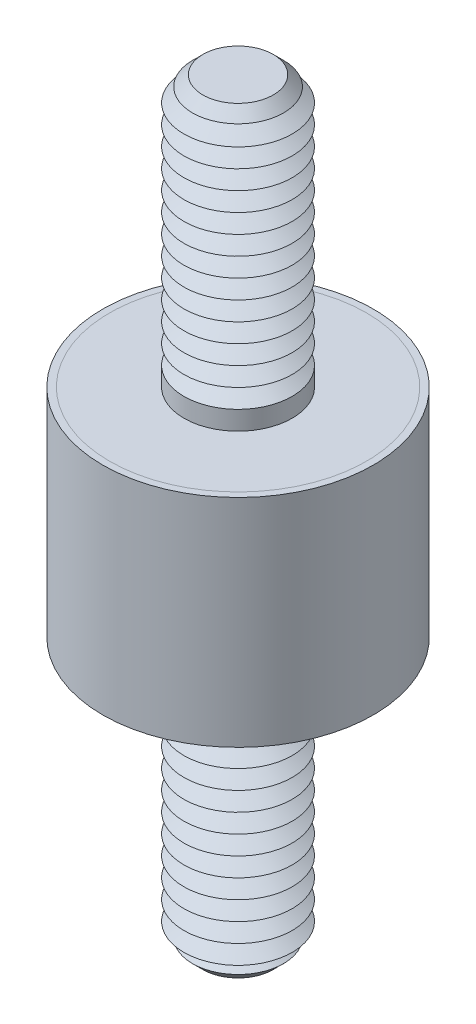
ISO-10303-21;
HEADER;
FILE_DESCRIPTION(('STEP AP214'),'2;1');
FILE_NAME('part.step','',(''),(''),'','','');
FILE_SCHEMA(('AUTOMOTIVE_DESIGN { 1 0 10303 214 1 1 1 1 }'));
ENDSEC;
DATA;
#1=APPLICATION_CONTEXT('core data for automotive mechanical design processes');
#2=APPLICATION_PROTOCOL_DEFINITION('international standard','automotive_design',2000,#1);
#3=PRODUCT_CONTEXT('',#1,'mechanical');
#4=PRODUCT('Part','Part','',(#3));
#5=PRODUCT_RELATED_PRODUCT_CATEGORY('part','',(#4));
#6=PRODUCT_DEFINITION_FORMATION('','',#4);
#7=PRODUCT_DEFINITION_CONTEXT('part definition',#1,'design');
#8=PRODUCT_DEFINITION('design','',#6,#7);
#9=PRODUCT_DEFINITION_SHAPE('','',#8);
#10=(LENGTH_UNIT() NAMED_UNIT(*) SI_UNIT(.MILLI.,.METRE.));
#11=(NAMED_UNIT(*) PLANE_ANGLE_UNIT() SI_UNIT($,.RADIAN.));
#12=(NAMED_UNIT(*) SI_UNIT($,.STERADIAN.) SOLID_ANGLE_UNIT());
#13=UNCERTAINTY_MEASURE_WITH_UNIT(LENGTH_MEASURE(1.E-05),#10,'distance_accuracy_value','');
#14=(GEOMETRIC_REPRESENTATION_CONTEXT(3) GLOBAL_UNCERTAINTY_ASSIGNED_CONTEXT((#13)) GLOBAL_UNIT_ASSIGNED_CONTEXT((#10,
#11,#12)) REPRESENTATION_CONTEXT('',''));
#15=CARTESIAN_POINT('',(0.,0.,0.));
#16=DIRECTION('',(0.,0.,1.));
#17=DIRECTION('',(1.,0.,0.));
#18=AXIS2_PLACEMENT_3D('',#15,#16,#17);
#19=CARTESIAN_POINT('',(0.,-14.,0.));
#20=DIRECTION('',(0.,1.,0.));
#21=DIRECTION('',(0.,0.,1.));
#22=AXIS2_PLACEMENT_3D('',#19,#20,#21);
#23=CYLINDRICAL_SURFACE('',#22,2.);
#24=CARTESIAN_POINT('',(0.,-4.,0.));
#25=DIRECTION('',(0.,-1.,0.));
#26=DIRECTION('',(0.,0.,-1.));
#27=AXIS2_PLACEMENT_3D('',#24,#25,#26);
#28=CIRCLE('',#27,2.);
#29=CARTESIAN_POINT('',(0.,-4.,-2.));
#30=VERTEX_POINT('',#29);
#31=EDGE_CURVE('P0_E22',#30,#30,#28,.T.);
#32=ORIENTED_EDGE('',*,*,#31,.T.);
#33=EDGE_LOOP('',(#32));
#34=FACE_BOUND('',#33,.T.);
#35=CARTESIAN_POINT('',(0.,-4.7,0.));
#36=DIRECTION('',(0.,1.,0.));
#37=DIRECTION('',(0.,0.,1.));
#38=AXIS2_PLACEMENT_3D('',#35,#36,#37);
#39=CIRCLE('',#38,2.);
#40=CARTESIAN_POINT('',(0.,-4.7,2.));
#41=VERTEX_POINT('',#40);
#42=EDGE_CURVE('P0_E32',#41,#41,#39,.T.);
#43=ORIENTED_EDGE('',*,*,#42,.T.);
#44=EDGE_LOOP('',(#43));
#45=FACE_BOUND('',#44,.T.);
#46=ADVANCED_FACE('P0_F14',(#34,#45),#23,.T.);
#47=CARTESIAN_POINT('',(0.,-4.,0.));
#48=DIRECTION('',(0.,1.,0.));
#49=DIRECTION('',(0.,0.,1.));
#50=AXIS2_PLACEMENT_3D('',#47,#48,#49);
#51=CYLINDRICAL_SURFACE('',#50,4.75);
#52=CARTESIAN_POINT('',(0.,-4.,0.));
#53=DIRECTION('',(0.,1.,0.));
#54=DIRECTION('',(0.,0.,1.));
#55=AXIS2_PLACEMENT_3D('',#52,#53,#54);
#56=CIRCLE('',#55,4.75);
#57=CARTESIAN_POINT('',(0.,-4.,4.75));
#58=VERTEX_POINT('',#57);
#59=EDGE_CURVE('P0_E26',#58,#58,#56,.T.);
#60=ORIENTED_EDGE('',*,*,#59,.T.);
#61=EDGE_LOOP('',(#60));
#62=FACE_BOUND('',#61,.T.);
#63=CARTESIAN_POINT('',(0.,-3.5,0.));
#64=DIRECTION('',(0.,1.,0.));
#65=DIRECTION('',(0.,0.,1.));
#66=AXIS2_PLACEMENT_3D('',#63,#64,#65);
#67=CIRCLE('',#66,4.75);
#68=CARTESIAN_POINT('',(0.,-3.5,4.75));
#69=VERTEX_POINT('',#68);
#70=EDGE_CURVE('P0_E29',#69,#69,#67,.T.);
#71=ORIENTED_EDGE('',*,*,#70,.F.);
#72=EDGE_LOOP('',(#71));
#73=FACE_BOUND('',#72,.T.);
#74=ADVANCED_FACE('P0_F131',(#62,#73),#51,.T.);
#75=CARTESIAN_POINT('',(0.,-4.,0.));
#76=DIRECTION('',(0.,1.,0.));
#77=DIRECTION('',(0.,0.,1.));
#78=AXIS2_PLACEMENT_3D('',#75,#76,#77);
#79=PLANE('',#78);
#80=ORIENTED_EDGE('',*,*,#31,.F.);
#81=EDGE_LOOP('',(#80));
#82=FACE_BOUND('',#81,.T.);
#83=ORIENTED_EDGE('',*,*,#59,.F.);
#84=EDGE_LOOP('',(#83));
#85=FACE_BOUND('',#84,.T.);
#86=ADVANCED_FACE('P0_F137',(#82,#85),#79,.F.);
#87=CARTESIAN_POINT('',(0.,-3.5,0.));
#88=DIRECTION('',(0.,1.,0.));
#89=DIRECTION('',(0.,0.,1.));
#90=AXIS2_PLACEMENT_3D('',#87,#88,#89);
#91=PLANE('',#90);
#92=ORIENTED_EDGE('',*,*,#70,.T.);
#93=EDGE_LOOP('',(#92));
#94=FACE_BOUND('',#93,.T.);
#95=ADVANCED_FACE('P0_F144',(#94),#91,.T.);
#96=CARTESIAN_POINT('',(0.,-4.7,0.));
#97=DIRECTION('',(0.,1.,0.));
#98=DIRECTION('',(0.,0.,1.));
#99=AXIS2_PLACEMENT_3D('',#96,#97,#98);
#100=CONICAL_SURFACE('',#99,2.,1.0471975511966);
#101=CARTESIAN_POINT('',(0.,-5.05,0.));
#102=DIRECTION('',(0.,1.,0.));
#103=DIRECTION('',(0.,0.,1.));
#104=AXIS2_PLACEMENT_3D('',#101,#102,#103);
#105=CIRCLE('',#104,1.39378221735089);
#106=CARTESIAN_POINT('',(0.,-5.05,1.39378221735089));
#107=VERTEX_POINT('',#106);
#108=EDGE_CURVE('P0_E37',#107,#107,#105,.T.);
#109=ORIENTED_EDGE('',*,*,#108,.T.);
#110=EDGE_LOOP('',(#109));
#111=FACE_BOUND('',#110,.T.);
#112=ORIENTED_EDGE('',*,*,#42,.F.);
#113=EDGE_LOOP('',(#112));
#114=FACE_BOUND('',#113,.T.);
#115=ADVANCED_FACE('P0_F147',(#111,#114),#100,.T.);
#116=CARTESIAN_POINT('',(0.,-5.05,0.));
#117=DIRECTION('',(0.,-1.,0.));
#118=DIRECTION('',(0.,0.,-1.));
#119=AXIS2_PLACEMENT_3D('',#116,#117,#118);
#120=CONICAL_SURFACE('',#119,1.39378221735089,1.0471975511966);
#121=CARTESIAN_POINT('',(0.,-5.4,0.));
#122=DIRECTION('',(0.,1.,0.));
#123=DIRECTION('',(0.,0.,1.));
#124=AXIS2_PLACEMENT_3D('',#121,#122,#123);
#125=CIRCLE('',#124,2.);
#126=CARTESIAN_POINT('',(0.,-5.4,2.));
#127=VERTEX_POINT('',#126);
#128=EDGE_CURVE('P0_E40',#127,#127,#125,.T.);
#129=ORIENTED_EDGE('',*,*,#128,.T.);
#130=EDGE_LOOP('',(#129));
#131=FACE_BOUND('',#130,.T.);
#132=ORIENTED_EDGE('',*,*,#108,.F.);
#133=EDGE_LOOP('',(#132));
#134=FACE_BOUND('',#133,.T.);
#135=ADVANCED_FACE('P0_F152',(#131,#134),#120,.T.);
#136=CARTESIAN_POINT('',(0.,-5.4,0.));
#137=DIRECTION('',(0.,1.,0.));
#138=DIRECTION('',(0.,0.,1.));
#139=AXIS2_PLACEMENT_3D('',#136,#137,#138);
#140=CONICAL_SURFACE('',#139,2.,1.0471975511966);
#141=CARTESIAN_POINT('',(0.,-5.75,0.));
#142=DIRECTION('',(0.,1.,0.));
#143=DIRECTION('',(0.,0.,1.));
#144=AXIS2_PLACEMENT_3D('',#141,#142,#143);
#145=CIRCLE('',#144,1.39378221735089);
#146=CARTESIAN_POINT('',(0.,-5.75,1.39378221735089));
#147=VERTEX_POINT('',#146);
#148=EDGE_CURVE('P0_E43',#147,#147,#145,.T.);
#149=ORIENTED_EDGE('',*,*,#148,.T.);
#150=EDGE_LOOP('',(#149));
#151=FACE_BOUND('',#150,.T.);
#152=ORIENTED_EDGE('',*,*,#128,.F.);
#153=EDGE_LOOP('',(#152));
#154=FACE_BOUND('',#153,.T.);
#155=ADVANCED_FACE('P0_F159',(#151,#154),#140,.T.);
#156=CARTESIAN_POINT('',(0.,-5.75,0.));
#157=DIRECTION('',(0.,-1.,0.));
#158=DIRECTION('',(0.,0.,-1.));
#159=AXIS2_PLACEMENT_3D('',#156,#157,#158);
#160=CONICAL_SURFACE('',#159,1.39378221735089,1.0471975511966);
#161=CARTESIAN_POINT('',(0.,-6.1,0.));
#162=DIRECTION('',(0.,1.,0.));
#163=DIRECTION('',(0.,0.,1.));
#164=AXIS2_PLACEMENT_3D('',#161,#162,#163);
#165=CIRCLE('',#164,2.);
#166=CARTESIAN_POINT('',(0.,-6.1,2.));
#167=VERTEX_POINT('',#166);
#168=EDGE_CURVE('P0_E46',#167,#167,#165,.T.);
#169=ORIENTED_EDGE('',*,*,#168,.T.);
#170=EDGE_LOOP('',(#169));
#171=FACE_BOUND('',#170,.T.);
#172=ORIENTED_EDGE('',*,*,#148,.F.);
#173=EDGE_LOOP('',(#172));
#174=FACE_BOUND('',#173,.T.);
#175=ADVANCED_FACE('P0_F166',(#171,#174),#160,.T.);
#176=CARTESIAN_POINT('',(0.,-6.1,0.));
#177=DIRECTION('',(0.,1.,0.));
#178=DIRECTION('',(0.,0.,1.));
#179=AXIS2_PLACEMENT_3D('',#176,#177,#178);
#180=CONICAL_SURFACE('',#179,2.,1.0471975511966);
#181=CARTESIAN_POINT('',(0.,-6.45,0.));
#182=DIRECTION('',(0.,1.,0.));
#183=DIRECTION('',(0.,0.,1.));
#184=AXIS2_PLACEMENT_3D('',#181,#182,#183);
#185=CIRCLE('',#184,1.39378221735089);
#186=CARTESIAN_POINT('',(0.,-6.45,1.39378221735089));
#187=VERTEX_POINT('',#186);
#188=EDGE_CURVE('P0_E49',#187,#187,#185,.T.);
#189=ORIENTED_EDGE('',*,*,#188,.T.);
#190=EDGE_LOOP('',(#189));
#191=FACE_BOUND('',#190,.T.);
#192=ORIENTED_EDGE('',*,*,#168,.F.);
#193=EDGE_LOOP('',(#192));
#194=FACE_BOUND('',#193,.T.);
#195=ADVANCED_FACE('P0_F170',(#191,#194),#180,.T.);
#196=CARTESIAN_POINT('',(0.,-6.45,0.));
#197=DIRECTION('',(0.,-1.,0.));
#198=DIRECTION('',(0.,0.,-1.));
#199=AXIS2_PLACEMENT_3D('',#196,#197,#198);
#200=CONICAL_SURFACE('',#199,1.39378221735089,1.0471975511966);
#201=CARTESIAN_POINT('',(0.,-6.8,0.));
#202=DIRECTION('',(0.,1.,0.));
#203=DIRECTION('',(0.,0.,1.));
#204=AXIS2_PLACEMENT_3D('',#201,#202,#203);
#205=CIRCLE('',#204,2.);
#206=CARTESIAN_POINT('',(0.,-6.8,2.));
#207=VERTEX_POINT('',#206);
#208=EDGE_CURVE('P0_E52',#207,#207,#205,.T.);
#209=ORIENTED_EDGE('',*,*,#208,.T.);
#210=EDGE_LOOP('',(#209));
#211=FACE_BOUND('',#210,.T.);
#212=ORIENTED_EDGE('',*,*,#188,.F.);
#213=EDGE_LOOP('',(#212));
#214=FACE_BOUND('',#213,.T.);
#215=ADVANCED_FACE('P0_F174',(#211,#214),#200,.T.);
#216=CARTESIAN_POINT('',(0.,-6.8,0.));
#217=DIRECTION('',(0.,1.,0.));
#218=DIRECTION('',(0.,0.,1.));
#219=AXIS2_PLACEMENT_3D('',#216,#217,#218);
#220=CONICAL_SURFACE('',#219,2.,1.0471975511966);
#221=CARTESIAN_POINT('',(0.,-7.15,0.));
#222=DIRECTION('',(0.,1.,0.));
#223=DIRECTION('',(0.,0.,1.));
#224=AXIS2_PLACEMENT_3D('',#221,#222,#223);
#225=CIRCLE('',#224,1.39378221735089);
#226=CARTESIAN_POINT('',(0.,-7.15,1.39378221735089));
#227=VERTEX_POINT('',#226);
#228=EDGE_CURVE('P0_E55',#227,#227,#225,.T.);
#229=ORIENTED_EDGE('',*,*,#228,.T.);
#230=EDGE_LOOP('',(#229));
#231=FACE_BOUND('',#230,.T.);
#232=ORIENTED_EDGE('',*,*,#208,.F.);
#233=EDGE_LOOP('',(#232));
#234=FACE_BOUND('',#233,.T.);
#235=ADVANCED_FACE('P0_F178',(#231,#234),#220,.T.);
#236=CARTESIAN_POINT('',(0.,-7.15,0.));
#237=DIRECTION('',(0.,-1.,0.));
#238=DIRECTION('',(0.,0.,-1.));
#239=AXIS2_PLACEMENT_3D('',#236,#237,#238);
#240=CONICAL_SURFACE('',#239,1.39378221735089,1.0471975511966);
#241=CARTESIAN_POINT('',(0.,-7.5,0.));
#242=DIRECTION('',(0.,1.,0.));
#243=DIRECTION('',(0.,0.,1.));
#244=AXIS2_PLACEMENT_3D('',#241,#242,#243);
#245=CIRCLE('',#244,2.);
#246=CARTESIAN_POINT('',(0.,-7.5,2.));
#247=VERTEX_POINT('',#246);
#248=EDGE_CURVE('P0_E58',#247,#247,#245,.T.);
#249=ORIENTED_EDGE('',*,*,#248,.T.);
#250=EDGE_LOOP('',(#249));
#251=FACE_BOUND('',#250,.T.);
#252=ORIENTED_EDGE('',*,*,#228,.F.);
#253=EDGE_LOOP('',(#252));
#254=FACE_BOUND('',#253,.T.);
#255=ADVANCED_FACE('P0_F182',(#251,#254),#240,.T.);
#256=CARTESIAN_POINT('',(0.,-7.5,0.));
#257=DIRECTION('',(0.,1.,0.));
#258=DIRECTION('',(0.,0.,1.));
#259=AXIS2_PLACEMENT_3D('',#256,#257,#258);
#260=CONICAL_SURFACE('',#259,2.,1.0471975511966);
#261=CARTESIAN_POINT('',(0.,-7.85,0.));
#262=DIRECTION('',(0.,1.,0.));
#263=DIRECTION('',(0.,0.,1.));
#264=AXIS2_PLACEMENT_3D('',#261,#262,#263);
#265=CIRCLE('',#264,1.39378221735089);
#266=CARTESIAN_POINT('',(0.,-7.85,1.39378221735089));
#267=VERTEX_POINT('',#266);
#268=EDGE_CURVE('P0_E61',#267,#267,#265,.T.);
#269=ORIENTED_EDGE('',*,*,#268,.T.);
#270=EDGE_LOOP('',(#269));
#271=FACE_BOUND('',#270,.T.);
#272=ORIENTED_EDGE('',*,*,#248,.F.);
#273=EDGE_LOOP('',(#272));
#274=FACE_BOUND('',#273,.T.);
#275=ADVANCED_FACE('P0_F186',(#271,#274),#260,.T.);
#276=CARTESIAN_POINT('',(0.,-7.85,0.));
#277=DIRECTION('',(0.,-1.,0.));
#278=DIRECTION('',(0.,0.,-1.));
#279=AXIS2_PLACEMENT_3D('',#276,#277,#278);
#280=CONICAL_SURFACE('',#279,1.39378221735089,1.0471975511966);
#281=CARTESIAN_POINT('',(0.,-8.2,0.));
#282=DIRECTION('',(0.,1.,0.));
#283=DIRECTION('',(0.,0.,1.));
#284=AXIS2_PLACEMENT_3D('',#281,#282,#283);
#285=CIRCLE('',#284,2.);
#286=CARTESIAN_POINT('',(0.,-8.2,2.));
#287=VERTEX_POINT('',#286);
#288=EDGE_CURVE('P0_E64',#287,#287,#285,.T.);
#289=ORIENTED_EDGE('',*,*,#288,.T.);
#290=EDGE_LOOP('',(#289));
#291=FACE_BOUND('',#290,.T.);
#292=ORIENTED_EDGE('',*,*,#268,.F.);
#293=EDGE_LOOP('',(#292));
#294=FACE_BOUND('',#293,.T.);
#295=ADVANCED_FACE('P0_F190',(#291,#294),#280,.T.);
#296=CARTESIAN_POINT('',(0.,-8.2,0.));
#297=DIRECTION('',(0.,1.,0.));
#298=DIRECTION('',(0.,0.,1.));
#299=AXIS2_PLACEMENT_3D('',#296,#297,#298);
#300=CONICAL_SURFACE('',#299,2.,1.0471975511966);
#301=CARTESIAN_POINT('',(0.,-8.55,0.));
#302=DIRECTION('',(0.,1.,0.));
#303=DIRECTION('',(0.,0.,1.));
#304=AXIS2_PLACEMENT_3D('',#301,#302,#303);
#305=CIRCLE('',#304,1.39378221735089);
#306=CARTESIAN_POINT('',(0.,-8.55,1.39378221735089));
#307=VERTEX_POINT('',#306);
#308=EDGE_CURVE('P0_E67',#307,#307,#305,.T.);
#309=ORIENTED_EDGE('',*,*,#308,.T.);
#310=EDGE_LOOP('',(#309));
#311=FACE_BOUND('',#310,.T.);
#312=ORIENTED_EDGE('',*,*,#288,.F.);
#313=EDGE_LOOP('',(#312));
#314=FACE_BOUND('',#313,.T.);
#315=ADVANCED_FACE('P0_F194',(#311,#314),#300,.T.);
#316=CARTESIAN_POINT('',(0.,-8.55,0.));
#317=DIRECTION('',(0.,-1.,0.));
#318=DIRECTION('',(0.,0.,-1.));
#319=AXIS2_PLACEMENT_3D('',#316,#317,#318);
#320=CONICAL_SURFACE('',#319,1.39378221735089,1.0471975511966);
#321=CARTESIAN_POINT('',(0.,-8.9,0.));
#322=DIRECTION('',(0.,1.,0.));
#323=DIRECTION('',(0.,0.,1.));
#324=AXIS2_PLACEMENT_3D('',#321,#322,#323);
#325=CIRCLE('',#324,2.);
#326=CARTESIAN_POINT('',(0.,-8.9,2.));
#327=VERTEX_POINT('',#326);
#328=EDGE_CURVE('P0_E70',#327,#327,#325,.T.);
#329=ORIENTED_EDGE('',*,*,#328,.T.);
#330=EDGE_LOOP('',(#329));
#331=FACE_BOUND('',#330,.T.);
#332=ORIENTED_EDGE('',*,*,#308,.F.);
#333=EDGE_LOOP('',(#332));
#334=FACE_BOUND('',#333,.T.);
#335=ADVANCED_FACE('P0_F198',(#331,#334),#320,.T.);
#336=CARTESIAN_POINT('',(0.,-8.9,0.));
#337=DIRECTION('',(0.,1.,0.));
#338=DIRECTION('',(0.,0.,1.));
#339=AXIS2_PLACEMENT_3D('',#336,#337,#338);
#340=CONICAL_SURFACE('',#339,2.,1.0471975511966);
#341=CARTESIAN_POINT('',(0.,-9.25,0.));
#342=DIRECTION('',(0.,1.,0.));
#343=DIRECTION('',(0.,0.,1.));
#344=AXIS2_PLACEMENT_3D('',#341,#342,#343);
#345=CIRCLE('',#344,1.39378221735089);
#346=CARTESIAN_POINT('',(0.,-9.25,1.39378221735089));
#347=VERTEX_POINT('',#346);
#348=EDGE_CURVE('P0_E73',#347,#347,#345,.T.);
#349=ORIENTED_EDGE('',*,*,#348,.T.);
#350=EDGE_LOOP('',(#349));
#351=FACE_BOUND('',#350,.T.);
#352=ORIENTED_EDGE('',*,*,#328,.F.);
#353=EDGE_LOOP('',(#352));
#354=FACE_BOUND('',#353,.T.);
#355=ADVANCED_FACE('P0_F202',(#351,#354),#340,.T.);
#356=CARTESIAN_POINT('',(0.,-9.25,0.));
#357=DIRECTION('',(0.,-1.,0.));
#358=DIRECTION('',(0.,0.,-1.));
#359=AXIS2_PLACEMENT_3D('',#356,#357,#358);
#360=CONICAL_SURFACE('',#359,1.39378221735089,1.0471975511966);
#361=CARTESIAN_POINT('',(0.,-9.6,0.));
#362=DIRECTION('',(0.,1.,0.));
#363=DIRECTION('',(0.,0.,1.));
#364=AXIS2_PLACEMENT_3D('',#361,#362,#363);
#365=CIRCLE('',#364,2.);
#366=CARTESIAN_POINT('',(0.,-9.6,2.));
#367=VERTEX_POINT('',#366);
#368=EDGE_CURVE('P0_E76',#367,#367,#365,.T.);
#369=ORIENTED_EDGE('',*,*,#368,.T.);
#370=EDGE_LOOP('',(#369));
#371=FACE_BOUND('',#370,.T.);
#372=ORIENTED_EDGE('',*,*,#348,.F.);
#373=EDGE_LOOP('',(#372));
#374=FACE_BOUND('',#373,.T.);
#375=ADVANCED_FACE('P0_F206',(#371,#374),#360,.T.);
#376=CARTESIAN_POINT('',(0.,-9.6,0.));
#377=DIRECTION('',(0.,1.,0.));
#378=DIRECTION('',(0.,0.,1.));
#379=AXIS2_PLACEMENT_3D('',#376,#377,#378);
#380=CONICAL_SURFACE('',#379,2.,1.0471975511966);
#381=CARTESIAN_POINT('',(0.,-9.95,0.));
#382=DIRECTION('',(0.,1.,0.));
#383=DIRECTION('',(0.,0.,1.));
#384=AXIS2_PLACEMENT_3D('',#381,#382,#383);
#385=CIRCLE('',#384,1.39378221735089);
#386=CARTESIAN_POINT('',(0.,-9.95,1.39378221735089));
#387=VERTEX_POINT('',#386);
#388=EDGE_CURVE('P0_E79',#387,#387,#385,.T.);
#389=ORIENTED_EDGE('',*,*,#388,.T.);
#390=EDGE_LOOP('',(#389));
#391=FACE_BOUND('',#390,.T.);
#392=ORIENTED_EDGE('',*,*,#368,.F.);
#393=EDGE_LOOP('',(#392));
#394=FACE_BOUND('',#393,.T.);
#395=ADVANCED_FACE('P0_F210',(#391,#394),#380,.T.);
#396=CARTESIAN_POINT('',(0.,-9.95,0.));
#397=DIRECTION('',(0.,-1.,0.));
#398=DIRECTION('',(0.,0.,-1.));
#399=AXIS2_PLACEMENT_3D('',#396,#397,#398);
#400=CONICAL_SURFACE('',#399,1.39378221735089,1.0471975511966);
#401=CARTESIAN_POINT('',(0.,-10.3,0.));
#402=DIRECTION('',(0.,1.,0.));
#403=DIRECTION('',(0.,0.,1.));
#404=AXIS2_PLACEMENT_3D('',#401,#402,#403);
#405=CIRCLE('',#404,2.);
#406=CARTESIAN_POINT('',(0.,-10.3,2.));
#407=VERTEX_POINT('',#406);
#408=EDGE_CURVE('P0_E82',#407,#407,#405,.T.);
#409=ORIENTED_EDGE('',*,*,#408,.T.);
#410=EDGE_LOOP('',(#409));
#411=FACE_BOUND('',#410,.T.);
#412=ORIENTED_EDGE('',*,*,#388,.F.);
#413=EDGE_LOOP('',(#412));
#414=FACE_BOUND('',#413,.T.);
#415=ADVANCED_FACE('P0_F214',(#411,#414),#400,.T.);
#416=CARTESIAN_POINT('',(0.,-10.3,0.));
#417=DIRECTION('',(0.,1.,0.));
#418=DIRECTION('',(0.,0.,1.));
#419=AXIS2_PLACEMENT_3D('',#416,#417,#418);
#420=CONICAL_SURFACE('',#419,2.,1.0471975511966);
#421=CARTESIAN_POINT('',(0.,-10.65,0.));
#422=DIRECTION('',(0.,1.,0.));
#423=DIRECTION('',(0.,0.,1.));
#424=AXIS2_PLACEMENT_3D('',#421,#422,#423);
#425=CIRCLE('',#424,1.39378221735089);
#426=CARTESIAN_POINT('',(0.,-10.65,1.39378221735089));
#427=VERTEX_POINT('',#426);
#428=EDGE_CURVE('P0_E85',#427,#427,#425,.T.);
#429=ORIENTED_EDGE('',*,*,#428,.T.);
#430=EDGE_LOOP('',(#429));
#431=FACE_BOUND('',#430,.T.);
#432=ORIENTED_EDGE('',*,*,#408,.F.);
#433=EDGE_LOOP('',(#432));
#434=FACE_BOUND('',#433,.T.);
#435=ADVANCED_FACE('P0_F218',(#431,#434),#420,.T.);
#436=CARTESIAN_POINT('',(0.,-10.65,0.));
#437=DIRECTION('',(0.,-1.,0.));
#438=DIRECTION('',(0.,0.,-1.));
#439=AXIS2_PLACEMENT_3D('',#436,#437,#438);
#440=CONICAL_SURFACE('',#439,1.39378221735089,1.0471975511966);
#441=CARTESIAN_POINT('',(0.,-11.,0.));
#442=DIRECTION('',(0.,1.,0.));
#443=DIRECTION('',(0.,0.,1.));
#444=AXIS2_PLACEMENT_3D('',#441,#442,#443);
#445=CIRCLE('',#444,2.);
#446=CARTESIAN_POINT('',(0.,-11.,2.));
#447=VERTEX_POINT('',#446);
#448=EDGE_CURVE('P0_E88',#447,#447,#445,.T.);
#449=ORIENTED_EDGE('',*,*,#448,.T.);
#450=EDGE_LOOP('',(#449));
#451=FACE_BOUND('',#450,.T.);
#452=ORIENTED_EDGE('',*,*,#428,.F.);
#453=EDGE_LOOP('',(#452));
#454=FACE_BOUND('',#453,.T.);
#455=ADVANCED_FACE('P0_F222',(#451,#454),#440,.T.);
#456=CARTESIAN_POINT('',(0.,-11.,0.));
#457=DIRECTION('',(0.,1.,0.));
#458=DIRECTION('',(0.,0.,1.));
#459=AXIS2_PLACEMENT_3D('',#456,#457,#458);
#460=CONICAL_SURFACE('',#459,2.,1.0471975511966);
#461=CARTESIAN_POINT('',(0.,-11.35,0.));
#462=DIRECTION('',(0.,1.,0.));
#463=DIRECTION('',(0.,0.,1.));
#464=AXIS2_PLACEMENT_3D('',#461,#462,#463);
#465=CIRCLE('',#464,1.39378221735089);
#466=CARTESIAN_POINT('',(0.,-11.35,1.39378221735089));
#467=VERTEX_POINT('',#466);
#468=EDGE_CURVE('P0_E91',#467,#467,#465,.T.);
#469=ORIENTED_EDGE('',*,*,#468,.T.);
#470=EDGE_LOOP('',(#469));
#471=FACE_BOUND('',#470,.T.);
#472=ORIENTED_EDGE('',*,*,#448,.F.);
#473=EDGE_LOOP('',(#472));
#474=FACE_BOUND('',#473,.T.);
#475=ADVANCED_FACE('P0_F226',(#471,#474),#460,.T.);
#476=CARTESIAN_POINT('',(0.,-11.35,0.));
#477=DIRECTION('',(0.,-1.,0.));
#478=DIRECTION('',(0.,0.,-1.));
#479=AXIS2_PLACEMENT_3D('',#476,#477,#478);
#480=CONICAL_SURFACE('',#479,1.39378221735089,1.0471975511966);
#481=CARTESIAN_POINT('',(0.,-11.7,0.));
#482=DIRECTION('',(0.,1.,0.));
#483=DIRECTION('',(0.,0.,1.));
#484=AXIS2_PLACEMENT_3D('',#481,#482,#483);
#485=CIRCLE('',#484,2.);
#486=CARTESIAN_POINT('',(0.,-11.7,2.));
#487=VERTEX_POINT('',#486);
#488=EDGE_CURVE('P0_E94',#487,#487,#485,.T.);
#489=ORIENTED_EDGE('',*,*,#488,.T.);
#490=EDGE_LOOP('',(#489));
#491=FACE_BOUND('',#490,.T.);
#492=ORIENTED_EDGE('',*,*,#468,.F.);
#493=EDGE_LOOP('',(#492));
#494=FACE_BOUND('',#493,.T.);
#495=ADVANCED_FACE('P0_F230',(#491,#494),#480,.T.);
#496=CARTESIAN_POINT('',(0.,-11.7,0.));
#497=DIRECTION('',(0.,1.,0.));
#498=DIRECTION('',(0.,0.,1.));
#499=AXIS2_PLACEMENT_3D('',#496,#497,#498);
#500=CONICAL_SURFACE('',#499,2.,1.0471975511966);
#501=CARTESIAN_POINT('',(0.,-12.05,0.));
#502=DIRECTION('',(0.,1.,0.));
#503=DIRECTION('',(0.,0.,1.));
#504=AXIS2_PLACEMENT_3D('',#501,#502,#503);
#505=CIRCLE('',#504,1.39378221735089);
#506=CARTESIAN_POINT('',(0.,-12.05,1.39378221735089));
#507=VERTEX_POINT('',#506);
#508=EDGE_CURVE('P0_E97',#507,#507,#505,.T.);
#509=ORIENTED_EDGE('',*,*,#508,.T.);
#510=EDGE_LOOP('',(#509));
#511=FACE_BOUND('',#510,.T.);
#512=ORIENTED_EDGE('',*,*,#488,.F.);
#513=EDGE_LOOP('',(#512));
#514=FACE_BOUND('',#513,.T.);
#515=ADVANCED_FACE('P0_F234',(#511,#514),#500,.T.);
#516=CARTESIAN_POINT('',(0.,-12.05,0.));
#517=DIRECTION('',(0.,-1.,0.));
#518=DIRECTION('',(0.,0.,-1.));
#519=AXIS2_PLACEMENT_3D('',#516,#517,#518);
#520=CONICAL_SURFACE('',#519,1.39378221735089,1.0471975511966);
#521=CARTESIAN_POINT('',(0.,-12.4,0.));
#522=DIRECTION('',(0.,1.,0.));
#523=DIRECTION('',(0.,0.,1.));
#524=AXIS2_PLACEMENT_3D('',#521,#522,#523);
#525=CIRCLE('',#524,2.);
#526=CARTESIAN_POINT('',(0.,-12.4,2.));
#527=VERTEX_POINT('',#526);
#528=EDGE_CURVE('P0_E100',#527,#527,#525,.T.);
#529=ORIENTED_EDGE('',*,*,#528,.T.);
#530=EDGE_LOOP('',(#529));
#531=FACE_BOUND('',#530,.T.);
#532=ORIENTED_EDGE('',*,*,#508,.F.);
#533=EDGE_LOOP('',(#532));
#534=FACE_BOUND('',#533,.T.);
#535=ADVANCED_FACE('P0_F238',(#531,#534),#520,.T.);
#536=CARTESIAN_POINT('',(0.,-12.4,0.));
#537=DIRECTION('',(0.,1.,0.));
#538=DIRECTION('',(0.,0.,1.));
#539=AXIS2_PLACEMENT_3D('',#536,#537,#538);
#540=CONICAL_SURFACE('',#539,2.,1.0471975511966);
#541=CARTESIAN_POINT('',(0.,-12.75,0.));
#542=DIRECTION('',(0.,1.,0.));
#543=DIRECTION('',(0.,0.,1.));
#544=AXIS2_PLACEMENT_3D('',#541,#542,#543);
#545=CIRCLE('',#544,1.39378221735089);
#546=CARTESIAN_POINT('',(0.,-12.75,1.39378221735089));
#547=VERTEX_POINT('',#546);
#548=EDGE_CURVE('P0_E103',#547,#547,#545,.T.);
#549=ORIENTED_EDGE('',*,*,#548,.T.);
#550=EDGE_LOOP('',(#549));
#551=FACE_BOUND('',#550,.T.);
#552=ORIENTED_EDGE('',*,*,#528,.F.);
#553=EDGE_LOOP('',(#552));
#554=FACE_BOUND('',#553,.T.);
#555=ADVANCED_FACE('P0_F242',(#551,#554),#540,.T.);
#556=CARTESIAN_POINT('',(0.,-12.75,0.));
#557=DIRECTION('',(0.,-1.,0.));
#558=DIRECTION('',(0.,0.,-1.));
#559=AXIS2_PLACEMENT_3D('',#556,#557,#558);
#560=CONICAL_SURFACE('',#559,1.39378221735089,1.0471975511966);
#561=CARTESIAN_POINT('',(0.,-13.1,0.));
#562=DIRECTION('',(0.,1.,0.));
#563=DIRECTION('',(0.,0.,1.));
#564=AXIS2_PLACEMENT_3D('',#561,#562,#563);
#565=CIRCLE('',#564,2.);
#566=CARTESIAN_POINT('',(0.,-13.1,2.));
#567=VERTEX_POINT('',#566);
#568=EDGE_CURVE('P0_E106',#567,#567,#565,.T.);
#569=ORIENTED_EDGE('',*,*,#568,.T.);
#570=EDGE_LOOP('',(#569));
#571=FACE_BOUND('',#570,.T.);
#572=ORIENTED_EDGE('',*,*,#548,.F.);
#573=EDGE_LOOP('',(#572));
#574=FACE_BOUND('',#573,.T.);
#575=ADVANCED_FACE('P0_F127',(#571,#574),#560,.T.);
#576=CARTESIAN_POINT('',(0.,-13.1,0.));
#577=DIRECTION('',(0.,1.,0.));
#578=DIRECTION('',(0.,0.,1.));
#579=AXIS2_PLACEMENT_3D('',#576,#577,#578);
#580=CONICAL_SURFACE('',#579,2.,1.0471975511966);
#581=CARTESIAN_POINT('',(0.,-13.45,0.));
#582=DIRECTION('',(0.,1.,0.));
#583=DIRECTION('',(0.,0.,1.));
#584=AXIS2_PLACEMENT_3D('',#581,#582,#583);
#585=CIRCLE('',#584,1.39378221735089);
#586=CARTESIAN_POINT('',(0.,-13.45,1.39378221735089));
#587=VERTEX_POINT('',#586);
#588=EDGE_CURVE('P0_E109',#587,#587,#585,.T.);
#589=ORIENTED_EDGE('',*,*,#588,.T.);
#590=EDGE_LOOP('',(#589));
#591=FACE_BOUND('',#590,.T.);
#592=ORIENTED_EDGE('',*,*,#568,.F.);
#593=EDGE_LOOP('',(#592));
#594=FACE_BOUND('',#593,.T.);
#595=ADVANCED_FACE('P0_F113',(#591,#594),#580,.T.);
#596=CARTESIAN_POINT('',(0.,-13.45,0.));
#597=DIRECTION('',(0.,-1.,0.));
#598=DIRECTION('',(0.,0.,-1.));
#599=AXIS2_PLACEMENT_3D('',#596,#597,#598);
#600=CONICAL_SURFACE('',#599,1.39378221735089,1.0471975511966);
#601=CARTESIAN_POINT('',(0.,-13.6169872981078,0.));
#602=DIRECTION('',(0.,-1.,0.));
#603=DIRECTION('',(0.,0.,-1.));
#604=AXIS2_PLACEMENT_3D('',#601,#602,#603);
#605=CIRCLE('',#604,1.68301270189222);
#606=CARTESIAN_POINT('',(0.,-13.6169872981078,1.68301270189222));
#607=VERTEX_POINT('',#606);
#608=EDGE_CURVE('P0_E18',#607,#607,#605,.T.);
#609=ORIENTED_EDGE('',*,*,#608,.F.);
#610=EDGE_LOOP('',(#609));
#611=FACE_BOUND('',#610,.T.);
#612=ORIENTED_EDGE('',*,*,#588,.F.);
#613=EDGE_LOOP('',(#612));
#614=FACE_BOUND('',#613,.T.);
#615=ADVANCED_FACE('P0_F116',(#611,#614),#600,.T.);
#616=CARTESIAN_POINT('',(0.,-14.,0.));
#617=DIRECTION('',(0.,-1.,0.));
#618=DIRECTION('',(0.,0.,-1.));
#619=AXIS2_PLACEMENT_3D('',#616,#617,#618);
#620=PLANE('',#619);
#621=CARTESIAN_POINT('',(0.,-14.,0.));
#622=DIRECTION('',(0.,-1.,0.));
#623=DIRECTION('',(0.,0.,-1.));
#624=AXIS2_PLACEMENT_3D('',#621,#622,#623);
#625=CIRCLE('',#624,1.3);
#626=CARTESIAN_POINT('',(0.,-14.,1.30000000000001));
#627=VERTEX_POINT('',#626);
#628=EDGE_CURVE('P0_E10',#627,#627,#625,.T.);
#629=ORIENTED_EDGE('',*,*,#628,.T.);
#630=EDGE_LOOP('',(#629));
#631=FACE_BOUND('',#630,.T.);
#632=ADVANCED_FACE('P0_F118',(#631),#620,.T.);
#633=CARTESIAN_POINT('',(0.,-14.,0.));
#634=DIRECTION('',(0.,1.,0.));
#635=DIRECTION('',(0.,0.,1.));
#636=AXIS2_PLACEMENT_3D('',#633,#634,#635);
#637=CONICAL_SURFACE('',#636,1.3,0.785398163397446);
#638=CARTESIAN_POINT('',(0.,-14.,1.30000000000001));
#639=CARTESIAN_POINT('',(0.,-13.9960102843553,1.30398971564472));
#640=CARTESIAN_POINT('',(0.,-13.9920205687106,1.30797943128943));
#641=CARTESIAN_POINT('',(0.,-13.9840411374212,1.31595886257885));
#642=CARTESIAN_POINT('',(0.,-13.9800514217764,1.31994857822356));
#643=CARTESIAN_POINT('',(0.,-13.972071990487,1.32792800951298));
#644=CARTESIAN_POINT('',(0.,-13.9680822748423,1.33191772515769));
#645=CARTESIAN_POINT('',(0.,-13.9601028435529,1.33989715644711));
#646=CARTESIAN_POINT('',(0.,-13.9561131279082,1.34388687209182));
#647=CARTESIAN_POINT('',(0.,-13.9481336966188,1.35186630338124));
#648=CARTESIAN_POINT('',(0.,-13.9441439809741,1.35585601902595));
#649=CARTESIAN_POINT('',(0.,-13.9361645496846,1.36383545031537));
#650=CARTESIAN_POINT('',(0.,-13.9321748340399,1.36782516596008));
#651=CARTESIAN_POINT('',(0.,-13.9241954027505,1.37580459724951));
#652=CARTESIAN_POINT('',(0.,-13.9202056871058,1.37979431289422));
#653=CARTESIAN_POINT('',(0.,-13.9122262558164,1.38777374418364));
#654=CARTESIAN_POINT('',(0.,-13.9082365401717,1.39176345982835));
#655=CARTESIAN_POINT('',(0.,-13.9002571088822,1.39974289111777));
#656=CARTESIAN_POINT('',(0.,-13.8962673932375,1.40373260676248));
#657=CARTESIAN_POINT('',(0.,-13.8882879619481,1.4117120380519));
#658=CARTESIAN_POINT('',(0.,-13.8842982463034,1.41570175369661));
#659=CARTESIAN_POINT('',(0.,-13.876318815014,1.42368118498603));
#660=CARTESIAN_POINT('',(0.,-13.8723290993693,1.42767090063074));
#661=CARTESIAN_POINT('',(0.,-13.8643496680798,1.43565033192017));
#662=CARTESIAN_POINT('',(0.,-13.8603599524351,1.43964004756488));
#663=CARTESIAN_POINT('',(0.,-13.8523805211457,1.4476194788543));
#664=CARTESIAN_POINT('',(0.,-13.848390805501,1.45160919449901));
#665=CARTESIAN_POINT('',(0.,-13.8404113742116,1.45958862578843));
#666=CARTESIAN_POINT('',(0.,-13.8364216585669,1.46357834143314));
#667=CARTESIAN_POINT('',(0.,-13.8284422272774,1.47155777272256));
#668=CARTESIAN_POINT('',(0.,-13.8244525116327,1.47554748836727));
#669=CARTESIAN_POINT('',(0.,-13.8164730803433,1.48352691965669));
#670=CARTESIAN_POINT('',(0.,-13.8124833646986,1.4875166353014));
#671=CARTESIAN_POINT('',(0.,-13.8045039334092,1.49549606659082));
#672=CARTESIAN_POINT('',(0.,-13.8005142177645,1.49948578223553));
#673=CARTESIAN_POINT('',(0.,-13.792534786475,1.50746521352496));
#674=CARTESIAN_POINT('',(0.,-13.7885450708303,1.51145492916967));
#675=CARTESIAN_POINT('',(0.,-13.7805656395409,1.51943436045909));
#676=CARTESIAN_POINT('',(0.,-13.7765759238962,1.5234240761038));
#677=CARTESIAN_POINT('',(0.,-13.7685964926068,1.53140350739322));
#678=CARTESIAN_POINT('',(0.,-13.7646067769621,1.53539322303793));
#679=CARTESIAN_POINT('',(0.,-13.7566273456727,1.54337265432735));
#680=CARTESIAN_POINT('',(0.,-13.7526376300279,1.54736236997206));
#681=CARTESIAN_POINT('',(0.,-13.7446581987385,1.55534180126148));
#682=CARTESIAN_POINT('',(0.,-13.7406684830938,1.55933151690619));
#683=CARTESIAN_POINT('',(0.,-13.7326890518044,1.56731094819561));
#684=CARTESIAN_POINT('',(0.,-13.7286993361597,1.57130066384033));
#685=CARTESIAN_POINT('',(0.,-13.7207199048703,1.57928009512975));
#686=CARTESIAN_POINT('',(0.,-13.7167301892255,1.58326981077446));
#687=CARTESIAN_POINT('',(0.,-13.7087507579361,1.59124924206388));
#688=CARTESIAN_POINT('',(0.,-13.7047610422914,1.59523895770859));
#689=CARTESIAN_POINT('',(0.,-13.696781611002,1.60321838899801));
#690=CARTESIAN_POINT('',(0.,-13.6927918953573,1.60720810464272));
#691=CARTESIAN_POINT('',(0.,-13.6848124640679,1.61518753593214));
#692=CARTESIAN_POINT('',(0.,-13.6808227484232,1.61917725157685));
#693=CARTESIAN_POINT('',(0.,-13.6728433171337,1.62715668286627));
#694=CARTESIAN_POINT('',(0.,-13.668853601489,1.63114639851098));
#695=CARTESIAN_POINT('',(0.,-13.6608741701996,1.63912582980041));
#696=CARTESIAN_POINT('',(0.,-13.6568844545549,1.64311554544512));
#697=CARTESIAN_POINT('',(0.,-13.6489050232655,1.65109497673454));
#698=CARTESIAN_POINT('',(0.,-13.6449153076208,1.65508469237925));
#699=CARTESIAN_POINT('',(0.,-13.6369358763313,1.66306412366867));
#700=CARTESIAN_POINT('',(0.,-13.6329461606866,1.66705383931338));
#701=CARTESIAN_POINT('',(0.,-13.6249667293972,1.6750332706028));
#702=CARTESIAN_POINT('',(0.,-13.6209770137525,1.67902298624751));
#703=CARTESIAN_POINT('',(0.,-13.6169872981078,1.68301270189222));
#704=B_SPLINE_CURVE_WITH_KNOTS('',3,(#638,#639,#640,#641,#642,#643,#644,#645,#646,#647,#648,
#649,#650,#651,#652,#653,#654,#655,#656,#657,#658,#659,#660,#661,#662,#663,#664,#665,#666,#667,
#668,#669,#670,#671,#672,#673,#674,#675,#676,#677,#678,#679,#680,#681,#682,#683,#684,#685,#686,
#687,#688,#689,#690,#691,#692,#693,#694,#695,#696,#697,#698,#699,#700,#701,#702,#703),
.UNSPECIFIED.,.F.,.F.,(4,2,2,2,2,2,2,2,2,2,2,2,2,2,2,2,2,2,2,2,2,2,2,2,2,2,2,2,2,2,2,2,4),(0.,
0.0169269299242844,0.0338538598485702,0.050780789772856,0.0677077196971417,0.0846346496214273,
0.101561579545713,0.118488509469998,0.135415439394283,0.152342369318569,0.169269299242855,
0.18619622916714,0.203123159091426,0.220050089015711,0.236977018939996,0.253903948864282,
0.270830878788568,0.287757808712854,0.304684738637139,0.321611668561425,0.33853859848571,
0.355465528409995,0.372392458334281,0.389319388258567,0.406246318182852,0.423173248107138,
0.440100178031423,0.457027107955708,0.473954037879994,0.49088096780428,0.507807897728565,
0.524734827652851,0.541661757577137),.UNSPECIFIED.);
#705=EDGE_CURVE('P0_BSEAM16',#627,#607,#704,.T.);
#706=ORIENTED_EDGE('',*,*,#628,.F.);
#707=ORIENTED_EDGE('',*,*,#608,.T.);
#708=ORIENTED_EDGE('',*,*,#705,.T.);
#709=ORIENTED_EDGE('',*,*,#705,.F.);
#710=EDGE_LOOP('',(#706,#708,#707,#709));
#711=FACE_BOUND('',#710,.T.);
#712=ADVANCED_FACE('P0_F16',(#711),#637,.T.);
#713=CLOSED_SHELL('',(#46,#74,#86,#95,#115,#135,#155,#175,#195,#215,#235,#255,#275,#295,#315,
#335,#355,#375,#395,#415,#435,#455,#475,#495,#515,#535,#555,#575,#595,#615,#632,#712));
#714=MANIFOLD_SOLID_BREP('P0_B1',#713);
#715=CARTESIAN_POINT('',(0.,14.,0.));
#716=DIRECTION('',(0.,-1.,0.));
#717=DIRECTION('',(0.,0.,-1.));
#718=AXIS2_PLACEMENT_3D('',#715,#716,#717);
#719=CYLINDRICAL_SURFACE('',#718,2.);
#720=CARTESIAN_POINT('',(0.,4.7,0.));
#721=DIRECTION('',(0.,1.,0.));
#722=DIRECTION('',(0.,0.,1.));
#723=AXIS2_PLACEMENT_3D('',#720,#721,#722);
#724=CIRCLE('',#723,2.);
#725=CARTESIAN_POINT('',(0.,4.7,2.));
#726=VERTEX_POINT('',#725);
#727=EDGE_CURVE('P1_E32',#726,#726,#724,.T.);
#728=ORIENTED_EDGE('',*,*,#727,.F.);
#729=EDGE_LOOP('',(#728));
#730=FACE_BOUND('',#729,.T.);
#731=CARTESIAN_POINT('',(0.,4.,0.));
#732=DIRECTION('',(0.,1.,0.));
#733=DIRECTION('',(0.,0.,1.));
#734=AXIS2_PLACEMENT_3D('',#731,#732,#733);
#735=CIRCLE('',#734,2.);
#736=CARTESIAN_POINT('',(0.,4.,2.));
#737=VERTEX_POINT('',#736);
#738=EDGE_CURVE('P1_E22',#737,#737,#735,.T.);
#739=ORIENTED_EDGE('',*,*,#738,.T.);
#740=EDGE_LOOP('',(#739));
#741=FACE_BOUND('',#740,.T.);
#742=ADVANCED_FACE('P1_F14',(#730,#741),#719,.T.);
#743=CARTESIAN_POINT('',(0.,4.,0.));
#744=DIRECTION('',(0.,-1.,0.));
#745=DIRECTION('',(0.,0.,-1.));
#746=AXIS2_PLACEMENT_3D('',#743,#744,#745);
#747=CYLINDRICAL_SURFACE('',#746,4.75);
#748=CARTESIAN_POINT('',(0.,4.,0.));
#749=DIRECTION('',(0.,1.,0.));
#750=DIRECTION('',(0.,0.,1.));
#751=AXIS2_PLACEMENT_3D('',#748,#749,#750);
#752=CIRCLE('',#751,4.75);
#753=CARTESIAN_POINT('',(0.,4.,4.75));
#754=VERTEX_POINT('',#753);
#755=EDGE_CURVE('P1_E26',#754,#754,#752,.T.);
#756=ORIENTED_EDGE('',*,*,#755,.F.);
#757=EDGE_LOOP('',(#756));
#758=FACE_BOUND('',#757,.T.);
#759=CARTESIAN_POINT('',(0.,3.5,0.));
#760=DIRECTION('',(0.,1.,0.));
#761=DIRECTION('',(0.,0.,1.));
#762=AXIS2_PLACEMENT_3D('',#759,#760,#761);
#763=CIRCLE('',#762,4.75);
#764=CARTESIAN_POINT('',(0.,3.5,4.75));
#765=VERTEX_POINT('',#764);
#766=EDGE_CURVE('P1_E29',#765,#765,#763,.T.);
#767=ORIENTED_EDGE('',*,*,#766,.T.);
#768=EDGE_LOOP('',(#767));
#769=FACE_BOUND('',#768,.T.);
#770=ADVANCED_FACE('P1_F268',(#758,#769),#747,.T.);
#771=CARTESIAN_POINT('',(0.,4.,0.));
#772=DIRECTION('',(0.,1.,0.));
#773=DIRECTION('',(0.,0.,1.));
#774=AXIS2_PLACEMENT_3D('',#771,#772,#773);
#775=PLANE('',#774);
#776=ORIENTED_EDGE('',*,*,#738,.F.);
#777=EDGE_LOOP('',(#776));
#778=FACE_BOUND('',#777,.T.);
#779=ORIENTED_EDGE('',*,*,#755,.T.);
#780=EDGE_LOOP('',(#779));
#781=FACE_BOUND('',#780,.T.);
#782=ADVANCED_FACE('P1_F272',(#778,#781),#775,.T.);
#783=CARTESIAN_POINT('',(0.,3.5,0.));
#784=DIRECTION('',(0.,1.,0.));
#785=DIRECTION('',(0.,0.,1.));
#786=AXIS2_PLACEMENT_3D('',#783,#784,#785);
#787=PLANE('',#786);
#788=ORIENTED_EDGE('',*,*,#766,.F.);
#789=EDGE_LOOP('',(#788));
#790=FACE_BOUND('',#789,.T.);
#791=ADVANCED_FACE('P1_F262',(#790),#787,.F.);
#792=CARTESIAN_POINT('',(0.,4.7,0.));
#793=DIRECTION('',(0.,-1.,0.));
#794=DIRECTION('',(0.,0.,-1.));
#795=AXIS2_PLACEMENT_3D('',#792,#793,#794);
#796=CONICAL_SURFACE('',#795,2.,1.0471975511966);
#797=CARTESIAN_POINT('',(0.,5.05,0.));
#798=DIRECTION('',(0.,1.,0.));
#799=DIRECTION('',(0.,0.,1.));
#800=AXIS2_PLACEMENT_3D('',#797,#798,#799);
#801=CIRCLE('',#800,1.39378221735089);
#802=CARTESIAN_POINT('',(0.,5.05,1.39378221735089));
#803=VERTEX_POINT('',#802);
#804=EDGE_CURVE('P1_E37',#803,#803,#801,.T.);
#805=ORIENTED_EDGE('',*,*,#804,.F.);
#806=EDGE_LOOP('',(#805));
#807=FACE_BOUND('',#806,.T.);
#808=ORIENTED_EDGE('',*,*,#727,.T.);
#809=EDGE_LOOP('',(#808));
#810=FACE_BOUND('',#809,.T.);
#811=ADVANCED_FACE('P1_F256',(#807,#810),#796,.T.);
#812=CARTESIAN_POINT('',(0.,5.05,0.));
#813=DIRECTION('',(0.,1.,0.));
#814=DIRECTION('',(0.,0.,1.));
#815=AXIS2_PLACEMENT_3D('',#812,#813,#814);
#816=CONICAL_SURFACE('',#815,1.39378221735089,1.0471975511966);
#817=CARTESIAN_POINT('',(0.,5.4,0.));
#818=DIRECTION('',(0.,1.,0.));
#819=DIRECTION('',(0.,0.,1.));
#820=AXIS2_PLACEMENT_3D('',#817,#818,#819);
#821=CIRCLE('',#820,2.);
#822=CARTESIAN_POINT('',(0.,5.4,2.));
#823=VERTEX_POINT('',#822);
#824=EDGE_CURVE('P1_E40',#823,#823,#821,.T.);
#825=ORIENTED_EDGE('',*,*,#824,.F.);
#826=EDGE_LOOP('',(#825));
#827=FACE_BOUND('',#826,.T.);
#828=ORIENTED_EDGE('',*,*,#804,.T.);
#829=EDGE_LOOP('',(#828));
#830=FACE_BOUND('',#829,.T.);
#831=ADVANCED_FACE('P1_F250',(#827,#830),#816,.T.);
#832=CARTESIAN_POINT('',(0.,5.4,0.));
#833=DIRECTION('',(0.,-1.,0.));
#834=DIRECTION('',(0.,0.,-1.));
#835=AXIS2_PLACEMENT_3D('',#832,#833,#834);
#836=CONICAL_SURFACE('',#835,2.,1.0471975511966);
#837=CARTESIAN_POINT('',(0.,5.75,0.));
#838=DIRECTION('',(0.,1.,0.));
#839=DIRECTION('',(0.,0.,1.));
#840=AXIS2_PLACEMENT_3D('',#837,#838,#839);
#841=CIRCLE('',#840,1.39378221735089);
#842=CARTESIAN_POINT('',(0.,5.75,1.39378221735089));
#843=VERTEX_POINT('',#842);
#844=EDGE_CURVE('P1_E43',#843,#843,#841,.T.);
#845=ORIENTED_EDGE('',*,*,#844,.F.);
#846=EDGE_LOOP('',(#845));
#847=FACE_BOUND('',#846,.T.);
#848=ORIENTED_EDGE('',*,*,#824,.T.);
#849=EDGE_LOOP('',(#848));
#850=FACE_BOUND('',#849,.T.);
#851=ADVANCED_FACE('P1_F244',(#847,#850),#836,.T.);
#852=CARTESIAN_POINT('',(0.,5.75,0.));
#853=DIRECTION('',(0.,1.,0.));
#854=DIRECTION('',(0.,0.,1.));
#855=AXIS2_PLACEMENT_3D('',#852,#853,#854);
#856=CONICAL_SURFACE('',#855,1.39378221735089,1.0471975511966);
#857=CARTESIAN_POINT('',(0.,6.1,0.));
#858=DIRECTION('',(0.,1.,0.));
#859=DIRECTION('',(0.,0.,1.));
#860=AXIS2_PLACEMENT_3D('',#857,#858,#859);
#861=CIRCLE('',#860,2.);
#862=CARTESIAN_POINT('',(0.,6.1,2.));
#863=VERTEX_POINT('',#862);
#864=EDGE_CURVE('P1_E46',#863,#863,#861,.T.);
#865=ORIENTED_EDGE('',*,*,#864,.F.);
#866=EDGE_LOOP('',(#865));
#867=FACE_BOUND('',#866,.T.);
#868=ORIENTED_EDGE('',*,*,#844,.T.);
#869=EDGE_LOOP('',(#868));
#870=FACE_BOUND('',#869,.T.);
#871=ADVANCED_FACE('P1_F238',(#867,#870),#856,.T.);
#872=CARTESIAN_POINT('',(0.,6.1,0.));
#873=DIRECTION('',(0.,-1.,0.));
#874=DIRECTION('',(0.,0.,-1.));
#875=AXIS2_PLACEMENT_3D('',#872,#873,#874);
#876=CONICAL_SURFACE('',#875,2.,1.0471975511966);
#877=CARTESIAN_POINT('',(0.,6.45,0.));
#878=DIRECTION('',(0.,1.,0.));
#879=DIRECTION('',(0.,0.,1.));
#880=AXIS2_PLACEMENT_3D('',#877,#878,#879);
#881=CIRCLE('',#880,1.39378221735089);
#882=CARTESIAN_POINT('',(0.,6.45,1.39378221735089));
#883=VERTEX_POINT('',#882);
#884=EDGE_CURVE('P1_E49',#883,#883,#881,.T.);
#885=ORIENTED_EDGE('',*,*,#884,.F.);
#886=EDGE_LOOP('',(#885));
#887=FACE_BOUND('',#886,.T.);
#888=ORIENTED_EDGE('',*,*,#864,.T.);
#889=EDGE_LOOP('',(#888));
#890=FACE_BOUND('',#889,.T.);
#891=ADVANCED_FACE('P1_F232',(#887,#890),#876,.T.);
#892=CARTESIAN_POINT('',(0.,6.45,0.));
#893=DIRECTION('',(0.,1.,0.));
#894=DIRECTION('',(0.,0.,1.));
#895=AXIS2_PLACEMENT_3D('',#892,#893,#894);
#896=CONICAL_SURFACE('',#895,1.39378221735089,1.0471975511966);
#897=CARTESIAN_POINT('',(0.,6.8,0.));
#898=DIRECTION('',(0.,1.,0.));
#899=DIRECTION('',(0.,0.,1.));
#900=AXIS2_PLACEMENT_3D('',#897,#898,#899);
#901=CIRCLE('',#900,2.);
#902=CARTESIAN_POINT('',(0.,6.8,2.));
#903=VERTEX_POINT('',#902);
#904=EDGE_CURVE('P1_E52',#903,#903,#901,.T.);
#905=ORIENTED_EDGE('',*,*,#904,.F.);
#906=EDGE_LOOP('',(#905));
#907=FACE_BOUND('',#906,.T.);
#908=ORIENTED_EDGE('',*,*,#884,.T.);
#909=EDGE_LOOP('',(#908));
#910=FACE_BOUND('',#909,.T.);
#911=ADVANCED_FACE('P1_F226',(#907,#910),#896,.T.);
#912=CARTESIAN_POINT('',(0.,6.8,0.));
#913=DIRECTION('',(0.,-1.,0.));
#914=DIRECTION('',(0.,0.,-1.));
#915=AXIS2_PLACEMENT_3D('',#912,#913,#914);
#916=CONICAL_SURFACE('',#915,2.,1.0471975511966);
#917=CARTESIAN_POINT('',(0.,7.15,0.));
#918=DIRECTION('',(0.,1.,0.));
#919=DIRECTION('',(0.,0.,1.));
#920=AXIS2_PLACEMENT_3D('',#917,#918,#919);
#921=CIRCLE('',#920,1.39378221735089);
#922=CARTESIAN_POINT('',(0.,7.15,1.39378221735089));
#923=VERTEX_POINT('',#922);
#924=EDGE_CURVE('P1_E55',#923,#923,#921,.T.);
#925=ORIENTED_EDGE('',*,*,#924,.F.);
#926=EDGE_LOOP('',(#925));
#927=FACE_BOUND('',#926,.T.);
#928=ORIENTED_EDGE('',*,*,#904,.T.);
#929=EDGE_LOOP('',(#928));
#930=FACE_BOUND('',#929,.T.);
#931=ADVANCED_FACE('P1_F220',(#927,#930),#916,.T.);
#932=CARTESIAN_POINT('',(0.,7.15,0.));
#933=DIRECTION('',(0.,1.,0.));
#934=DIRECTION('',(0.,0.,1.));
#935=AXIS2_PLACEMENT_3D('',#932,#933,#934);
#936=CONICAL_SURFACE('',#935,1.39378221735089,1.0471975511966);
#937=CARTESIAN_POINT('',(0.,7.5,0.));
#938=DIRECTION('',(0.,1.,0.));
#939=DIRECTION('',(0.,0.,1.));
#940=AXIS2_PLACEMENT_3D('',#937,#938,#939);
#941=CIRCLE('',#940,2.);
#942=CARTESIAN_POINT('',(0.,7.5,2.));
#943=VERTEX_POINT('',#942);
#944=EDGE_CURVE('P1_E58',#943,#943,#941,.T.);
#945=ORIENTED_EDGE('',*,*,#944,.F.);
#946=EDGE_LOOP('',(#945));
#947=FACE_BOUND('',#946,.T.);
#948=ORIENTED_EDGE('',*,*,#924,.T.);
#949=EDGE_LOOP('',(#948));
#950=FACE_BOUND('',#949,.T.);
#951=ADVANCED_FACE('P1_F214',(#947,#950),#936,.T.);
#952=CARTESIAN_POINT('',(0.,7.5,0.));
#953=DIRECTION('',(0.,-1.,0.));
#954=DIRECTION('',(0.,0.,-1.));
#955=AXIS2_PLACEMENT_3D('',#952,#953,#954);
#956=CONICAL_SURFACE('',#955,2.,1.0471975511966);
#957=CARTESIAN_POINT('',(0.,7.85,0.));
#958=DIRECTION('',(0.,1.,0.));
#959=DIRECTION('',(0.,0.,1.));
#960=AXIS2_PLACEMENT_3D('',#957,#958,#959);
#961=CIRCLE('',#960,1.39378221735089);
#962=CARTESIAN_POINT('',(0.,7.85,1.39378221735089));
#963=VERTEX_POINT('',#962);
#964=EDGE_CURVE('P1_E61',#963,#963,#961,.T.);
#965=ORIENTED_EDGE('',*,*,#964,.F.);
#966=EDGE_LOOP('',(#965));
#967=FACE_BOUND('',#966,.T.);
#968=ORIENTED_EDGE('',*,*,#944,.T.);
#969=EDGE_LOOP('',(#968));
#970=FACE_BOUND('',#969,.T.);
#971=ADVANCED_FACE('P1_F208',(#967,#970),#956,.T.);
#972=CARTESIAN_POINT('',(0.,7.85,0.));
#973=DIRECTION('',(0.,1.,0.));
#974=DIRECTION('',(0.,0.,1.));
#975=AXIS2_PLACEMENT_3D('',#972,#973,#974);
#976=CONICAL_SURFACE('',#975,1.39378221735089,1.0471975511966);
#977=CARTESIAN_POINT('',(0.,8.2,0.));
#978=DIRECTION('',(0.,1.,0.));
#979=DIRECTION('',(0.,0.,1.));
#980=AXIS2_PLACEMENT_3D('',#977,#978,#979);
#981=CIRCLE('',#980,2.);
#982=CARTESIAN_POINT('',(0.,8.2,2.));
#983=VERTEX_POINT('',#982);
#984=EDGE_CURVE('P1_E64',#983,#983,#981,.T.);
#985=ORIENTED_EDGE('',*,*,#984,.F.);
#986=EDGE_LOOP('',(#985));
#987=FACE_BOUND('',#986,.T.);
#988=ORIENTED_EDGE('',*,*,#964,.T.);
#989=EDGE_LOOP('',(#988));
#990=FACE_BOUND('',#989,.T.);
#991=ADVANCED_FACE('P1_F202',(#987,#990),#976,.T.);
#992=CARTESIAN_POINT('',(0.,8.2,0.));
#993=DIRECTION('',(0.,-1.,0.));
#994=DIRECTION('',(0.,0.,-1.));
#995=AXIS2_PLACEMENT_3D('',#992,#993,#994);
#996=CONICAL_SURFACE('',#995,2.,1.0471975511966);
#997=CARTESIAN_POINT('',(0.,8.55,0.));
#998=DIRECTION('',(0.,1.,0.));
#999=DIRECTION('',(0.,0.,1.));
#1000=AXIS2_PLACEMENT_3D('',#997,#998,#999);
#1001=CIRCLE('',#1000,1.39378221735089);
#1002=CARTESIAN_POINT('',(0.,8.55,1.39378221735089));
#1003=VERTEX_POINT('',#1002);
#1004=EDGE_CURVE('P1_E67',#1003,#1003,#1001,.T.);
#1005=ORIENTED_EDGE('',*,*,#1004,.F.);
#1006=EDGE_LOOP('',(#1005));
#1007=FACE_BOUND('',#1006,.T.);
#1008=ORIENTED_EDGE('',*,*,#984,.T.);
#1009=EDGE_LOOP('',(#1008));
#1010=FACE_BOUND('',#1009,.T.);
#1011=ADVANCED_FACE('P1_F196',(#1007,#1010),#996,.T.);
#1012=CARTESIAN_POINT('',(0.,8.55,0.));
#1013=DIRECTION('',(0.,1.,0.));
#1014=DIRECTION('',(0.,0.,1.));
#1015=AXIS2_PLACEMENT_3D('',#1012,#1013,#1014);
#1016=CONICAL_SURFACE('',#1015,1.39378221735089,1.0471975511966);
#1017=CARTESIAN_POINT('',(0.,8.9,0.));
#1018=DIRECTION('',(0.,1.,0.));
#1019=DIRECTION('',(0.,0.,1.));
#1020=AXIS2_PLACEMENT_3D('',#1017,#1018,#1019);
#1021=CIRCLE('',#1020,2.);
#1022=CARTESIAN_POINT('',(0.,8.9,2.));
#1023=VERTEX_POINT('',#1022);
#1024=EDGE_CURVE('P1_E70',#1023,#1023,#1021,.T.);
#1025=ORIENTED_EDGE('',*,*,#1024,.F.);
#1026=EDGE_LOOP('',(#1025));
#1027=FACE_BOUND('',#1026,.T.);
#1028=ORIENTED_EDGE('',*,*,#1004,.T.);
#1029=EDGE_LOOP('',(#1028));
#1030=FACE_BOUND('',#1029,.T.);
#1031=ADVANCED_FACE('P1_F190',(#1027,#1030),#1016,.T.);
#1032=CARTESIAN_POINT('',(0.,8.9,0.));
#1033=DIRECTION('',(0.,-1.,0.));
#1034=DIRECTION('',(0.,0.,-1.));
#1035=AXIS2_PLACEMENT_3D('',#1032,#1033,#1034);
#1036=CONICAL_SURFACE('',#1035,2.,1.0471975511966);
#1037=CARTESIAN_POINT('',(0.,9.25,0.));
#1038=DIRECTION('',(0.,1.,0.));
#1039=DIRECTION('',(0.,0.,1.));
#1040=AXIS2_PLACEMENT_3D('',#1037,#1038,#1039);
#1041=CIRCLE('',#1040,1.39378221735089);
#1042=CARTESIAN_POINT('',(0.,9.25,1.39378221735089));
#1043=VERTEX_POINT('',#1042);
#1044=EDGE_CURVE('P1_E73',#1043,#1043,#1041,.T.);
#1045=ORIENTED_EDGE('',*,*,#1044,.F.);
#1046=EDGE_LOOP('',(#1045));
#1047=FACE_BOUND('',#1046,.T.);
#1048=ORIENTED_EDGE('',*,*,#1024,.T.);
#1049=EDGE_LOOP('',(#1048));
#1050=FACE_BOUND('',#1049,.T.);
#1051=ADVANCED_FACE('P1_F184',(#1047,#1050),#1036,.T.);
#1052=CARTESIAN_POINT('',(0.,9.25,0.));
#1053=DIRECTION('',(0.,1.,0.));
#1054=DIRECTION('',(0.,0.,1.));
#1055=AXIS2_PLACEMENT_3D('',#1052,#1053,#1054);
#1056=CONICAL_SURFACE('',#1055,1.39378221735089,1.0471975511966);
#1057=CARTESIAN_POINT('',(0.,9.6,0.));
#1058=DIRECTION('',(0.,1.,0.));
#1059=DIRECTION('',(0.,0.,1.));
#1060=AXIS2_PLACEMENT_3D('',#1057,#1058,#1059);
#1061=CIRCLE('',#1060,2.);
#1062=CARTESIAN_POINT('',(0.,9.6,2.));
#1063=VERTEX_POINT('',#1062);
#1064=EDGE_CURVE('P1_E76',#1063,#1063,#1061,.T.);
#1065=ORIENTED_EDGE('',*,*,#1064,.F.);
#1066=EDGE_LOOP('',(#1065));
#1067=FACE_BOUND('',#1066,.T.);
#1068=ORIENTED_EDGE('',*,*,#1044,.T.);
#1069=EDGE_LOOP('',(#1068));
#1070=FACE_BOUND('',#1069,.T.);
#1071=ADVANCED_FACE('P1_F178',(#1067,#1070),#1056,.T.);
#1072=CARTESIAN_POINT('',(0.,9.6,0.));
#1073=DIRECTION('',(0.,-1.,0.));
#1074=DIRECTION('',(0.,0.,-1.));
#1075=AXIS2_PLACEMENT_3D('',#1072,#1073,#1074);
#1076=CONICAL_SURFACE('',#1075,2.,1.0471975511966);
#1077=CARTESIAN_POINT('',(0.,9.95,0.));
#1078=DIRECTION('',(0.,1.,0.));
#1079=DIRECTION('',(0.,0.,1.));
#1080=AXIS2_PLACEMENT_3D('',#1077,#1078,#1079);
#1081=CIRCLE('',#1080,1.39378221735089);
#1082=CARTESIAN_POINT('',(0.,9.95,1.39378221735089));
#1083=VERTEX_POINT('',#1082);
#1084=EDGE_CURVE('P1_E79',#1083,#1083,#1081,.T.);
#1085=ORIENTED_EDGE('',*,*,#1084,.F.);
#1086=EDGE_LOOP('',(#1085));
#1087=FACE_BOUND('',#1086,.T.);
#1088=ORIENTED_EDGE('',*,*,#1064,.T.);
#1089=EDGE_LOOP('',(#1088));
#1090=FACE_BOUND('',#1089,.T.);
#1091=ADVANCED_FACE('P1_F172',(#1087,#1090),#1076,.T.);
#1092=CARTESIAN_POINT('',(0.,9.95,0.));
#1093=DIRECTION('',(0.,1.,0.));
#1094=DIRECTION('',(0.,0.,1.));
#1095=AXIS2_PLACEMENT_3D('',#1092,#1093,#1094);
#1096=CONICAL_SURFACE('',#1095,1.39378221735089,1.0471975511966);
#1097=CARTESIAN_POINT('',(0.,10.3,0.));
#1098=DIRECTION('',(0.,1.,0.));
#1099=DIRECTION('',(0.,0.,1.));
#1100=AXIS2_PLACEMENT_3D('',#1097,#1098,#1099);
#1101=CIRCLE('',#1100,2.);
#1102=CARTESIAN_POINT('',(0.,10.3,2.));
#1103=VERTEX_POINT('',#1102);
#1104=EDGE_CURVE('P1_E82',#1103,#1103,#1101,.T.);
#1105=ORIENTED_EDGE('',*,*,#1104,.F.);
#1106=EDGE_LOOP('',(#1105));
#1107=FACE_BOUND('',#1106,.T.);
#1108=ORIENTED_EDGE('',*,*,#1084,.T.);
#1109=EDGE_LOOP('',(#1108));
#1110=FACE_BOUND('',#1109,.T.);
#1111=ADVANCED_FACE('P1_F166',(#1107,#1110),#1096,.T.);
#1112=CARTESIAN_POINT('',(0.,10.3,0.));
#1113=DIRECTION('',(0.,-1.,0.));
#1114=DIRECTION('',(0.,0.,-1.));
#1115=AXIS2_PLACEMENT_3D('',#1112,#1113,#1114);
#1116=CONICAL_SURFACE('',#1115,2.,1.0471975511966);
#1117=CARTESIAN_POINT('',(0.,10.65,0.));
#1118=DIRECTION('',(0.,1.,0.));
#1119=DIRECTION('',(0.,0.,1.));
#1120=AXIS2_PLACEMENT_3D('',#1117,#1118,#1119);
#1121=CIRCLE('',#1120,1.39378221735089);
#1122=CARTESIAN_POINT('',(0.,10.65,1.39378221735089));
#1123=VERTEX_POINT('',#1122);
#1124=EDGE_CURVE('P1_E85',#1123,#1123,#1121,.T.);
#1125=ORIENTED_EDGE('',*,*,#1124,.F.);
#1126=EDGE_LOOP('',(#1125));
#1127=FACE_BOUND('',#1126,.T.);
#1128=ORIENTED_EDGE('',*,*,#1104,.T.);
#1129=EDGE_LOOP('',(#1128));
#1130=FACE_BOUND('',#1129,.T.);
#1131=ADVANCED_FACE('P1_F160',(#1127,#1130),#1116,.T.);
#1132=CARTESIAN_POINT('',(0.,10.65,0.));
#1133=DIRECTION('',(0.,1.,0.));
#1134=DIRECTION('',(0.,0.,1.));
#1135=AXIS2_PLACEMENT_3D('',#1132,#1133,#1134);
#1136=CONICAL_SURFACE('',#1135,1.39378221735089,1.0471975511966);
#1137=CARTESIAN_POINT('',(0.,11.,0.));
#1138=DIRECTION('',(0.,1.,0.));
#1139=DIRECTION('',(0.,0.,1.));
#1140=AXIS2_PLACEMENT_3D('',#1137,#1138,#1139);
#1141=CIRCLE('',#1140,2.);
#1142=CARTESIAN_POINT('',(0.,11.,2.));
#1143=VERTEX_POINT('',#1142);
#1144=EDGE_CURVE('P1_E88',#1143,#1143,#1141,.T.);
#1145=ORIENTED_EDGE('',*,*,#1144,.F.);
#1146=EDGE_LOOP('',(#1145));
#1147=FACE_BOUND('',#1146,.T.);
#1148=ORIENTED_EDGE('',*,*,#1124,.T.);
#1149=EDGE_LOOP('',(#1148));
#1150=FACE_BOUND('',#1149,.T.);
#1151=ADVANCED_FACE('P1_F154',(#1147,#1150),#1136,.T.);
#1152=CARTESIAN_POINT('',(0.,11.,0.));
#1153=DIRECTION('',(0.,-1.,0.));
#1154=DIRECTION('',(0.,0.,-1.));
#1155=AXIS2_PLACEMENT_3D('',#1152,#1153,#1154);
#1156=CONICAL_SURFACE('',#1155,2.,1.0471975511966);
#1157=CARTESIAN_POINT('',(0.,11.35,0.));
#1158=DIRECTION('',(0.,1.,0.));
#1159=DIRECTION('',(0.,0.,1.));
#1160=AXIS2_PLACEMENT_3D('',#1157,#1158,#1159);
#1161=CIRCLE('',#1160,1.39378221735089);
#1162=CARTESIAN_POINT('',(0.,11.35,1.39378221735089));
#1163=VERTEX_POINT('',#1162);
#1164=EDGE_CURVE('P1_E91',#1163,#1163,#1161,.T.);
#1165=ORIENTED_EDGE('',*,*,#1164,.F.);
#1166=EDGE_LOOP('',(#1165));
#1167=FACE_BOUND('',#1166,.T.);
#1168=ORIENTED_EDGE('',*,*,#1144,.T.);
#1169=EDGE_LOOP('',(#1168));
#1170=FACE_BOUND('',#1169,.T.);
#1171=ADVANCED_FACE('P1_F148',(#1167,#1170),#1156,.T.);
#1172=CARTESIAN_POINT('',(0.,11.35,0.));
#1173=DIRECTION('',(0.,1.,0.));
#1174=DIRECTION('',(0.,0.,1.));
#1175=AXIS2_PLACEMENT_3D('',#1172,#1173,#1174);
#1176=CONICAL_SURFACE('',#1175,1.39378221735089,1.0471975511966);
#1177=CARTESIAN_POINT('',(0.,11.7,0.));
#1178=DIRECTION('',(0.,1.,0.));
#1179=DIRECTION('',(0.,0.,1.));
#1180=AXIS2_PLACEMENT_3D('',#1177,#1178,#1179);
#1181=CIRCLE('',#1180,2.);
#1182=CARTESIAN_POINT('',(0.,11.7,2.));
#1183=VERTEX_POINT('',#1182);
#1184=EDGE_CURVE('P1_E94',#1183,#1183,#1181,.T.);
#1185=ORIENTED_EDGE('',*,*,#1184,.F.);
#1186=EDGE_LOOP('',(#1185));
#1187=FACE_BOUND('',#1186,.T.);
#1188=ORIENTED_EDGE('',*,*,#1164,.T.);
#1189=EDGE_LOOP('',(#1188));
#1190=FACE_BOUND('',#1189,.T.);
#1191=ADVANCED_FACE('P1_F142',(#1187,#1190),#1176,.T.);
#1192=CARTESIAN_POINT('',(0.,11.7,0.));
#1193=DIRECTION('',(0.,-1.,0.));
#1194=DIRECTION('',(0.,0.,-1.));
#1195=AXIS2_PLACEMENT_3D('',#1192,#1193,#1194);
#1196=CONICAL_SURFACE('',#1195,2.,1.0471975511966);
#1197=CARTESIAN_POINT('',(0.,12.05,0.));
#1198=DIRECTION('',(0.,1.,0.));
#1199=DIRECTION('',(0.,0.,1.));
#1200=AXIS2_PLACEMENT_3D('',#1197,#1198,#1199);
#1201=CIRCLE('',#1200,1.39378221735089);
#1202=CARTESIAN_POINT('',(0.,12.05,1.39378221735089));
#1203=VERTEX_POINT('',#1202);
#1204=EDGE_CURVE('P1_E97',#1203,#1203,#1201,.T.);
#1205=ORIENTED_EDGE('',*,*,#1204,.F.);
#1206=EDGE_LOOP('',(#1205));
#1207=FACE_BOUND('',#1206,.T.);
#1208=ORIENTED_EDGE('',*,*,#1184,.T.);
#1209=EDGE_LOOP('',(#1208));
#1210=FACE_BOUND('',#1209,.T.);
#1211=ADVANCED_FACE('P1_F136',(#1207,#1210),#1196,.T.);
#1212=CARTESIAN_POINT('',(0.,12.05,0.));
#1213=DIRECTION('',(0.,1.,0.));
#1214=DIRECTION('',(0.,0.,1.));
#1215=AXIS2_PLACEMENT_3D('',#1212,#1213,#1214);
#1216=CONICAL_SURFACE('',#1215,1.39378221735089,1.0471975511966);
#1217=CARTESIAN_POINT('',(0.,12.4,0.));
#1218=DIRECTION('',(0.,1.,0.));
#1219=DIRECTION('',(0.,0.,1.));
#1220=AXIS2_PLACEMENT_3D('',#1217,#1218,#1219);
#1221=CIRCLE('',#1220,2.);
#1222=CARTESIAN_POINT('',(0.,12.4,2.));
#1223=VERTEX_POINT('',#1222);
#1224=EDGE_CURVE('P1_E100',#1223,#1223,#1221,.T.);
#1225=ORIENTED_EDGE('',*,*,#1224,.F.);
#1226=EDGE_LOOP('',(#1225));
#1227=FACE_BOUND('',#1226,.T.);
#1228=ORIENTED_EDGE('',*,*,#1204,.T.);
#1229=EDGE_LOOP('',(#1228));
#1230=FACE_BOUND('',#1229,.T.);
#1231=ADVANCED_FACE('P1_F130',(#1227,#1230),#1216,.T.);
#1232=CARTESIAN_POINT('',(0.,12.4,0.));
#1233=DIRECTION('',(0.,-1.,0.));
#1234=DIRECTION('',(0.,0.,-1.));
#1235=AXIS2_PLACEMENT_3D('',#1232,#1233,#1234);
#1236=CONICAL_SURFACE('',#1235,2.,1.0471975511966);
#1237=CARTESIAN_POINT('',(0.,12.75,0.));
#1238=DIRECTION('',(0.,1.,0.));
#1239=DIRECTION('',(0.,0.,1.));
#1240=AXIS2_PLACEMENT_3D('',#1237,#1238,#1239);
#1241=CIRCLE('',#1240,1.39378221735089);
#1242=CARTESIAN_POINT('',(0.,12.75,1.39378221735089));
#1243=VERTEX_POINT('',#1242);
#1244=EDGE_CURVE('P1_E103',#1243,#1243,#1241,.T.);
#1245=ORIENTED_EDGE('',*,*,#1244,.F.);
#1246=EDGE_LOOP('',(#1245));
#1247=FACE_BOUND('',#1246,.T.);
#1248=ORIENTED_EDGE('',*,*,#1224,.T.);
#1249=EDGE_LOOP('',(#1248));
#1250=FACE_BOUND('',#1249,.T.);
#1251=ADVANCED_FACE('P1_F124',(#1247,#1250),#1236,.T.);
#1252=CARTESIAN_POINT('',(0.,12.75,0.));
#1253=DIRECTION('',(0.,1.,0.));
#1254=DIRECTION('',(0.,0.,1.));
#1255=AXIS2_PLACEMENT_3D('',#1252,#1253,#1254);
#1256=CONICAL_SURFACE('',#1255,1.39378221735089,1.0471975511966);
#1257=CARTESIAN_POINT('',(0.,13.1,0.));
#1258=DIRECTION('',(0.,1.,0.));
#1259=DIRECTION('',(0.,0.,1.));
#1260=AXIS2_PLACEMENT_3D('',#1257,#1258,#1259);
#1261=CIRCLE('',#1260,2.);
#1262=CARTESIAN_POINT('',(0.,13.1,2.));
#1263=VERTEX_POINT('',#1262);
#1264=EDGE_CURVE('P1_E106',#1263,#1263,#1261,.T.);
#1265=ORIENTED_EDGE('',*,*,#1264,.F.);
#1266=EDGE_LOOP('',(#1265));
#1267=FACE_BOUND('',#1266,.T.);
#1268=ORIENTED_EDGE('',*,*,#1244,.T.);
#1269=EDGE_LOOP('',(#1268));
#1270=FACE_BOUND('',#1269,.T.);
#1271=ADVANCED_FACE('P1_F118',(#1267,#1270),#1256,.T.);
#1272=CARTESIAN_POINT('',(0.,13.1,0.));
#1273=DIRECTION('',(0.,-1.,0.));
#1274=DIRECTION('',(0.,0.,-1.));
#1275=AXIS2_PLACEMENT_3D('',#1272,#1273,#1274);
#1276=CONICAL_SURFACE('',#1275,2.,1.0471975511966);
#1277=CARTESIAN_POINT('',(0.,13.45,0.));
#1278=DIRECTION('',(0.,1.,0.));
#1279=DIRECTION('',(0.,0.,1.));
#1280=AXIS2_PLACEMENT_3D('',#1277,#1278,#1279);
#1281=CIRCLE('',#1280,1.39378221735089);
#1282=CARTESIAN_POINT('',(0.,13.45,1.39378221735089));
#1283=VERTEX_POINT('',#1282);
#1284=EDGE_CURVE('P1_E109',#1283,#1283,#1281,.T.);
#1285=ORIENTED_EDGE('',*,*,#1284,.F.);
#1286=EDGE_LOOP('',(#1285));
#1287=FACE_BOUND('',#1286,.T.);
#1288=ORIENTED_EDGE('',*,*,#1264,.T.);
#1289=EDGE_LOOP('',(#1288));
#1290=FACE_BOUND('',#1289,.T.);
#1291=ADVANCED_FACE('P1_F115',(#1287,#1290),#1276,.T.);
#1292=CARTESIAN_POINT('',(0.,13.45,0.));
#1293=DIRECTION('',(0.,1.,0.));
#1294=DIRECTION('',(0.,0.,1.));
#1295=AXIS2_PLACEMENT_3D('',#1292,#1293,#1294);
#1296=CONICAL_SURFACE('',#1295,1.39378221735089,1.0471975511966);
#1297=CARTESIAN_POINT('',(0.,13.6169872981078,0.));
#1298=DIRECTION('',(0.,1.,0.));
#1299=DIRECTION('',(0.,0.,1.));
#1300=AXIS2_PLACEMENT_3D('',#1297,#1298,#1299);
#1301=CIRCLE('',#1300,1.68301270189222);
#1302=CARTESIAN_POINT('',(0.,13.6169872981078,-1.68301270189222));
#1303=VERTEX_POINT('',#1302);
#1304=EDGE_CURVE('P1_E18',#1303,#1303,#1301,.F.);
#1305=ORIENTED_EDGE('',*,*,#1304,.T.);
#1306=EDGE_LOOP('',(#1305));
#1307=FACE_BOUND('',#1306,.T.);
#1308=ORIENTED_EDGE('',*,*,#1284,.T.);
#1309=EDGE_LOOP('',(#1308));
#1310=FACE_BOUND('',#1309,.T.);
#1311=ADVANCED_FACE('P1_F113',(#1307,#1310),#1296,.T.);
#1312=CARTESIAN_POINT('',(0.,14.,0.));
#1313=DIRECTION('',(0.,1.,0.));
#1314=DIRECTION('',(0.,0.,1.));
#1315=AXIS2_PLACEMENT_3D('',#1312,#1313,#1314);
#1316=PLANE('',#1315);
#1317=CARTESIAN_POINT('',(0.,14.,0.));
#1318=DIRECTION('',(0.,1.,0.));
#1319=DIRECTION('',(0.,0.,1.));
#1320=AXIS2_PLACEMENT_3D('',#1317,#1318,#1319);
#1321=CIRCLE('',#1320,1.3);
#1322=CARTESIAN_POINT('',(0.,14.,-1.30000000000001));
#1323=VERTEX_POINT('',#1322);
#1324=EDGE_CURVE('P1_E10',#1323,#1323,#1321,.T.);
#1325=ORIENTED_EDGE('',*,*,#1324,.T.);
#1326=EDGE_LOOP('',(#1325));
#1327=FACE_BOUND('',#1326,.T.);
#1328=ADVANCED_FACE('P1_F288',(#1327),#1316,.T.);
#1329=CARTESIAN_POINT('',(0.,14.,0.));
#1330=DIRECTION('',(0.,-1.,0.));
#1331=DIRECTION('',(0.,0.,-1.));
#1332=AXIS2_PLACEMENT_3D('',#1329,#1330,#1331);
#1333=CONICAL_SURFACE('',#1332,1.3,0.785398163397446);
#1334=CARTESIAN_POINT('',(0.,13.6169872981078,-1.68301270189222));
#1335=CARTESIAN_POINT('',(0.,13.6209770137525,-1.67902298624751));
#1336=CARTESIAN_POINT('',(0.,13.6249667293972,-1.6750332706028));
#1337=CARTESIAN_POINT('',(0.,13.6329461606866,-1.66705383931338));
#1338=CARTESIAN_POINT('',(0.,13.6369358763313,-1.66306412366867));
#1339=CARTESIAN_POINT('',(0.,13.6449153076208,-1.65508469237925));
#1340=CARTESIAN_POINT('',(0.,13.6489050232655,-1.65109497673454));
#1341=CARTESIAN_POINT('',(0.,13.6568844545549,-1.64311554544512));
#1342=CARTESIAN_POINT('',(0.,13.6608741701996,-1.63912582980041));
#1343=CARTESIAN_POINT('',(0.,13.668853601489,-1.63114639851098));
#1344=CARTESIAN_POINT('',(0.,13.6728433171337,-1.62715668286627));
#1345=CARTESIAN_POINT('',(0.,13.6808227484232,-1.61917725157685));
#1346=CARTESIAN_POINT('',(0.,13.6848124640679,-1.61518753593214));
#1347=CARTESIAN_POINT('',(0.,13.6927918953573,-1.60720810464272));
#1348=CARTESIAN_POINT('',(0.,13.696781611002,-1.60321838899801));
#1349=CARTESIAN_POINT('',(0.,13.7047610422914,-1.59523895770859));
#1350=CARTESIAN_POINT('',(0.,13.7087507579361,-1.59124924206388));
#1351=CARTESIAN_POINT('',(0.,13.7167301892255,-1.58326981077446));
#1352=CARTESIAN_POINT('',(0.,13.7207199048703,-1.57928009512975));
#1353=CARTESIAN_POINT('',(0.,13.7286993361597,-1.57130066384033));
#1354=CARTESIAN_POINT('',(0.,13.7326890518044,-1.56731094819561));
#1355=CARTESIAN_POINT('',(0.,13.7406684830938,-1.55933151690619));
#1356=CARTESIAN_POINT('',(0.,13.7446581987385,-1.55534180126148));
#1357=CARTESIAN_POINT('',(0.,13.7526376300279,-1.54736236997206));
#1358=CARTESIAN_POINT('',(0.,13.7566273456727,-1.54337265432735));
#1359=CARTESIAN_POINT('',(0.,13.7646067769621,-1.53539322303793));
#1360=CARTESIAN_POINT('',(0.,13.7685964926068,-1.53140350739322));
#1361=CARTESIAN_POINT('',(0.,13.7765759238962,-1.5234240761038));
#1362=CARTESIAN_POINT('',(0.,13.7805656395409,-1.51943436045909));
#1363=CARTESIAN_POINT('',(0.,13.7885450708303,-1.51145492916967));
#1364=CARTESIAN_POINT('',(0.,13.792534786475,-1.50746521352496));
#1365=CARTESIAN_POINT('',(0.,13.8005142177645,-1.49948578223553));
#1366=CARTESIAN_POINT('',(0.,13.8045039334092,-1.49549606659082));
#1367=CARTESIAN_POINT('',(0.,13.8124833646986,-1.4875166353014));
#1368=CARTESIAN_POINT('',(0.,13.8164730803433,-1.48352691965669));
#1369=CARTESIAN_POINT('',(0.,13.8244525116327,-1.47554748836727));
#1370=CARTESIAN_POINT('',(0.,13.8284422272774,-1.47155777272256));
#1371=CARTESIAN_POINT('',(0.,13.8364216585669,-1.46357834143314));
#1372=CARTESIAN_POINT('',(0.,13.8404113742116,-1.45958862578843));
#1373=CARTESIAN_POINT('',(0.,13.848390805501,-1.45160919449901));
#1374=CARTESIAN_POINT('',(0.,13.8523805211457,-1.4476194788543));
#1375=CARTESIAN_POINT('',(0.,13.8603599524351,-1.43964004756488));
#1376=CARTESIAN_POINT('',(0.,13.8643496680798,-1.43565033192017));
#1377=CARTESIAN_POINT('',(0.,13.8723290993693,-1.42767090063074));
#1378=CARTESIAN_POINT('',(0.,13.876318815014,-1.42368118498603));
#1379=CARTESIAN_POINT('',(0.,13.8842982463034,-1.41570175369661));
#1380=CARTESIAN_POINT('',(0.,13.8882879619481,-1.4117120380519));
#1381=CARTESIAN_POINT('',(0.,13.8962673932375,-1.40373260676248));
#1382=CARTESIAN_POINT('',(0.,13.9002571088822,-1.39974289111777));
#1383=CARTESIAN_POINT('',(0.,13.9082365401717,-1.39176345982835));
#1384=CARTESIAN_POINT('',(0.,13.9122262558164,-1.38777374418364));
#1385=CARTESIAN_POINT('',(0.,13.9202056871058,-1.37979431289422));
#1386=CARTESIAN_POINT('',(0.,13.9241954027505,-1.37580459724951));
#1387=CARTESIAN_POINT('',(0.,13.9321748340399,-1.36782516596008));
#1388=CARTESIAN_POINT('',(0.,13.9361645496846,-1.36383545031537));
#1389=CARTESIAN_POINT('',(0.,13.9441439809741,-1.35585601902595));
#1390=CARTESIAN_POINT('',(0.,13.9481336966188,-1.35186630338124));
#1391=CARTESIAN_POINT('',(0.,13.9561131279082,-1.34388687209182));
#1392=CARTESIAN_POINT('',(0.,13.9601028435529,-1.33989715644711));
#1393=CARTESIAN_POINT('',(0.,13.9680822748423,-1.33191772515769));
#1394=CARTESIAN_POINT('',(0.,13.972071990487,-1.32792800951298));
#1395=CARTESIAN_POINT('',(0.,13.9800514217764,-1.31994857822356));
#1396=CARTESIAN_POINT('',(0.,13.9840411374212,-1.31595886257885));
#1397=CARTESIAN_POINT('',(0.,13.9920205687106,-1.30797943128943));
#1398=CARTESIAN_POINT('',(0.,13.9960102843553,-1.30398971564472));
#1399=CARTESIAN_POINT('',(0.,14.,-1.30000000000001));
#1400=B_SPLINE_CURVE_WITH_KNOTS('',3,(#1334,#1335,#1336,#1337,#1338,#1339,#1340,#1341,#1342,
#1343,#1344,#1345,#1346,#1347,#1348,#1349,#1350,#1351,#1352,#1353,#1354,#1355,#1356,#1357,#1358,
#1359,#1360,#1361,#1362,#1363,#1364,#1365,#1366,#1367,#1368,#1369,#1370,#1371,#1372,#1373,#1374,
#1375,#1376,#1377,#1378,#1379,#1380,#1381,#1382,#1383,#1384,#1385,#1386,#1387,#1388,#1389,#1390,
#1391,#1392,#1393,#1394,#1395,#1396,#1397,#1398,#1399),.UNSPECIFIED.,.F.,.F.,(4,2,2,2,2,2,2,2,2,
2,2,2,2,2,2,2,2,2,2,2,2,2,2,2,2,2,2,2,2,2,2,2,4),(0.,0.0169269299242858,0.0338538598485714,
0.0507807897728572,0.0677077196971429,0.0846346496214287,0.101561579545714,0.118488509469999,
0.135415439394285,0.15234236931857,0.169269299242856,0.186196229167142,0.203123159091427,
0.220050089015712,0.236977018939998,0.253903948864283,0.270830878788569,0.287757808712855,
0.304684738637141,0.321611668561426,0.338538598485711,0.355465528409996,0.372392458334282,
0.389319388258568,0.406246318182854,0.423173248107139,0.440100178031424,0.45702710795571,
0.473954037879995,0.490880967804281,0.507807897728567,0.524734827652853,0.541661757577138),.UNSPECIFIED.);
#1401=EDGE_CURVE('P1_BSEAM16',#1303,#1323,#1400,.T.);
#1402=ORIENTED_EDGE('',*,*,#1304,.F.);
#1403=ORIENTED_EDGE('',*,*,#1324,.F.);
#1404=ORIENTED_EDGE('',*,*,#1401,.T.);
#1405=ORIENTED_EDGE('',*,*,#1401,.F.);
#1406=EDGE_LOOP('',(#1402,#1404,#1403,#1405));
#1407=FACE_BOUND('',#1406,.T.);
#1408=ADVANCED_FACE('P1_F16',(#1407),#1333,.T.);
#1409=CLOSED_SHELL('',(#742,#770,#782,#791,#811,#831,#851,#871,#891,#911,#931,#951,#971,#991,
#1011,#1031,#1051,#1071,#1091,#1111,#1131,#1151,#1171,#1191,#1211,#1231,#1251,#1271,#1291,#1311,
#1328,#1408));
#1410=MANIFOLD_SOLID_BREP('P1_B1',#1409);
#1411=CARTESIAN_POINT('',(0.,4.,0.));
#1412=DIRECTION('',(0.,-1.,0.));
#1413=DIRECTION('',(0.,0.,-1.));
#1414=AXIS2_PLACEMENT_3D('',#1411,#1412,#1413);
#1415=CYLINDRICAL_SURFACE('',#1414,5.);
#1416=CARTESIAN_POINT('',(0.,4.,0.));
#1417=DIRECTION('',(0.,1.,0.));
#1418=DIRECTION('',(0.,0.,1.));
#1419=AXIS2_PLACEMENT_3D('',#1416,#1417,#1418);
#1420=CIRCLE('',#1419,5.);
#1421=CARTESIAN_POINT('',(0.,4.,5.));
#1422=VERTEX_POINT('',#1421);
#1423=EDGE_CURVE('P2_E9',#1422,#1422,#1420,.T.);
#1424=ORIENTED_EDGE('',*,*,#1423,.F.);
#1425=EDGE_LOOP('',(#1424));
#1426=FACE_BOUND('',#1425,.T.);
#1427=CARTESIAN_POINT('',(0.,-4.,0.));
#1428=DIRECTION('',(0.,1.,0.));
#1429=DIRECTION('',(0.,0.,1.));
#1430=AXIS2_PLACEMENT_3D('',#1427,#1428,#1429);
#1431=CIRCLE('',#1430,5.);
#1432=CARTESIAN_POINT('',(0.,-4.,5.));
#1433=VERTEX_POINT('',#1432);
#1434=EDGE_CURVE('P2_E16',#1433,#1433,#1431,.T.);
#1435=ORIENTED_EDGE('',*,*,#1434,.T.);
#1436=EDGE_LOOP('',(#1435));
#1437=FACE_BOUND('',#1436,.T.);
#1438=ADVANCED_FACE('P2_F13',(#1426,#1437),#1415,.T.);
#1439=CARTESIAN_POINT('',(0.,4.,0.));
#1440=DIRECTION('',(0.,1.,0.));
#1441=DIRECTION('',(0.,0.,1.));
#1442=AXIS2_PLACEMENT_3D('',#1439,#1440,#1441);
#1443=PLANE('',#1442);
#1444=CARTESIAN_POINT('',(0.,4.,0.));
#1445=DIRECTION('',(0.,1.,0.));
#1446=DIRECTION('',(0.,0.,1.));
#1447=AXIS2_PLACEMENT_3D('',#1444,#1445,#1446);
#1448=CIRCLE('',#1447,4.75);
#1449=CARTESIAN_POINT('',(0.,4.,4.75));
#1450=VERTEX_POINT('',#1449);
#1451=EDGE_CURVE('P2_E25',#1450,#1450,#1448,.T.);
#1452=ORIENTED_EDGE('',*,*,#1451,.F.);
#1453=EDGE_LOOP('',(#1452));
#1454=FACE_BOUND('',#1453,.T.);
#1455=ORIENTED_EDGE('',*,*,#1423,.T.);
#1456=EDGE_LOOP('',(#1455));
#1457=FACE_BOUND('',#1456,.T.);
#1458=ADVANCED_FACE('P2_F50',(#1454,#1457),#1443,.T.);
#1459=CARTESIAN_POINT('',(0.,-4.,0.));
#1460=DIRECTION('',(0.,1.,0.));
#1461=DIRECTION('',(0.,0.,1.));
#1462=AXIS2_PLACEMENT_3D('',#1459,#1460,#1461);
#1463=PLANE('',#1462);
#1464=CARTESIAN_POINT('',(0.,-4.,0.));
#1465=DIRECTION('',(0.,1.,0.));
#1466=DIRECTION('',(0.,0.,1.));
#1467=AXIS2_PLACEMENT_3D('',#1464,#1465,#1466);
#1468=CIRCLE('',#1467,4.75);
#1469=CARTESIAN_POINT('',(0.,-4.,4.75));
#1470=VERTEX_POINT('',#1469);
#1471=EDGE_CURVE('P2_E31',#1470,#1470,#1468,.T.);
#1472=ORIENTED_EDGE('',*,*,#1471,.T.);
#1473=EDGE_LOOP('',(#1472));
#1474=FACE_BOUND('',#1473,.T.);
#1475=ORIENTED_EDGE('',*,*,#1434,.F.);
#1476=EDGE_LOOP('',(#1475));
#1477=FACE_BOUND('',#1476,.T.);
#1478=ADVANCED_FACE('P2_F55',(#1474,#1477),#1463,.F.);
#1479=CARTESIAN_POINT('',(0.,3.5,0.));
#1480=DIRECTION('',(0.,1.,0.));
#1481=DIRECTION('',(0.,0.,1.));
#1482=AXIS2_PLACEMENT_3D('',#1479,#1480,#1481);
#1483=CYLINDRICAL_SURFACE('',#1482,4.75);
#1484=CARTESIAN_POINT('',(0.,3.5,0.));
#1485=DIRECTION('',(0.,1.,0.));
#1486=DIRECTION('',(0.,0.,1.));
#1487=AXIS2_PLACEMENT_3D('',#1484,#1485,#1486);
#1488=CIRCLE('',#1487,4.75);
#1489=CARTESIAN_POINT('',(0.,3.5,4.75));
#1490=VERTEX_POINT('',#1489);
#1491=EDGE_CURVE('P2_E23',#1490,#1490,#1488,.T.);
#1492=ORIENTED_EDGE('',*,*,#1491,.F.);
#1493=EDGE_LOOP('',(#1492));
#1494=FACE_BOUND('',#1493,.T.);
#1495=ORIENTED_EDGE('',*,*,#1451,.T.);
#1496=EDGE_LOOP('',(#1495));
#1497=FACE_BOUND('',#1496,.T.);
#1498=ADVANCED_FACE('P2_F62',(#1494,#1497),#1483,.F.);
#1499=CARTESIAN_POINT('',(0.,3.5,0.));
#1500=DIRECTION('',(0.,1.,0.));
#1501=DIRECTION('',(0.,0.,1.));
#1502=AXIS2_PLACEMENT_3D('',#1499,#1500,#1501);
#1503=PLANE('',#1502);
#1504=ORIENTED_EDGE('',*,*,#1491,.T.);
#1505=EDGE_LOOP('',(#1504));
#1506=FACE_BOUND('',#1505,.T.);
#1507=ADVANCED_FACE('P2_F47',(#1506),#1503,.T.);
#1508=CARTESIAN_POINT('',(0.,-3.5,0.));
#1509=DIRECTION('',(0.,-1.,0.));
#1510=DIRECTION('',(0.,0.,-1.));
#1511=AXIS2_PLACEMENT_3D('',#1508,#1509,#1510);
#1512=CYLINDRICAL_SURFACE('',#1511,4.75);
#1513=CARTESIAN_POINT('',(0.,-3.5,0.));
#1514=DIRECTION('',(0.,1.,0.));
#1515=DIRECTION('',(0.,0.,1.));
#1516=AXIS2_PLACEMENT_3D('',#1513,#1514,#1515);
#1517=CIRCLE('',#1516,4.75);
#1518=CARTESIAN_POINT('',(0.,-3.5,4.75));
#1519=VERTEX_POINT('',#1518);
#1520=EDGE_CURVE('P2_E28',#1519,#1519,#1517,.T.);
#1521=ORIENTED_EDGE('',*,*,#1520,.T.);
#1522=EDGE_LOOP('',(#1521));
#1523=FACE_BOUND('',#1522,.T.);
#1524=ORIENTED_EDGE('',*,*,#1471,.F.);
#1525=EDGE_LOOP('',(#1524));
#1526=FACE_BOUND('',#1525,.T.);
#1527=ADVANCED_FACE('P2_F37',(#1523,#1526),#1512,.F.);
#1528=CARTESIAN_POINT('',(0.,-3.5,0.));
#1529=DIRECTION('',(0.,-1.,0.));
#1530=DIRECTION('',(0.,0.,1.));
#1531=AXIS2_PLACEMENT_3D('',#1528,#1529,#1530);
#1532=PLANE('',#1531);
#1533=ORIENTED_EDGE('',*,*,#1520,.F.);
#1534=EDGE_LOOP('',(#1533));
#1535=FACE_BOUND('',#1534,.T.);
#1536=ADVANCED_FACE('P2_F40',(#1535),#1532,.T.);
#1537=CLOSED_SHELL('',(#1438,#1458,#1478,#1498,#1507,#1527,#1536));
#1538=MANIFOLD_SOLID_BREP('P2_B1',#1537);
#1539=ADVANCED_BREP_SHAPE_REPRESENTATION('',(#18,#714,#1410,#1538),#14);
#1540=SHAPE_DEFINITION_REPRESENTATION(#9,#1539);
ENDSEC;
END-ISO-10303-21;
